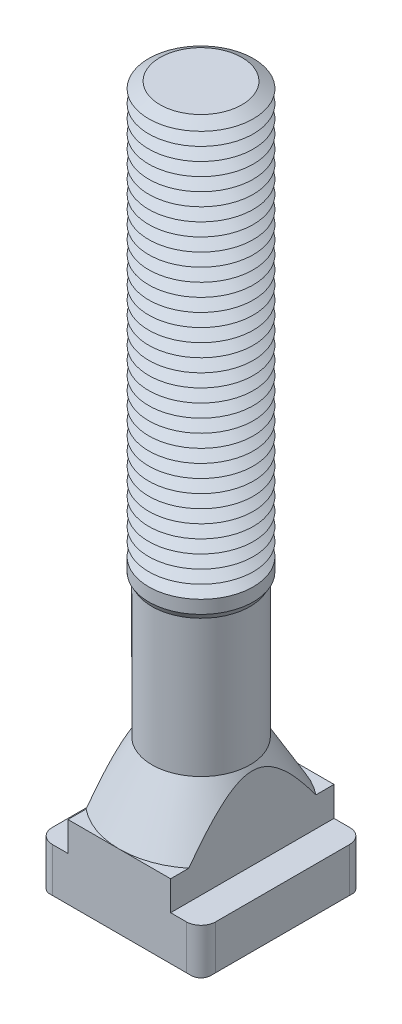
ISO-10303-21;
HEADER;
FILE_DESCRIPTION(('STEP AP214'),'2;1');
FILE_NAME('part.step','',(''),(''),'','','');
FILE_SCHEMA(('AUTOMOTIVE_DESIGN { 1 0 10303 214 1 1 1 1 }'));
ENDSEC;
DATA;
#1=APPLICATION_CONTEXT('core data for automotive mechanical design processes');
#2=APPLICATION_PROTOCOL_DEFINITION('international standard','automotive_design',2000,#1);
#3=PRODUCT_CONTEXT('',#1,'mechanical');
#4=PRODUCT('Part','Part','',(#3));
#5=PRODUCT_RELATED_PRODUCT_CATEGORY('part','',(#4));
#6=PRODUCT_DEFINITION_FORMATION('','',#4);
#7=PRODUCT_DEFINITION_CONTEXT('part definition',#1,'design');
#8=PRODUCT_DEFINITION('design','',#6,#7);
#9=PRODUCT_DEFINITION_SHAPE('','',#8);
#10=(LENGTH_UNIT() NAMED_UNIT(*) SI_UNIT(.MILLI.,.METRE.));
#11=(NAMED_UNIT(*) PLANE_ANGLE_UNIT() SI_UNIT($,.RADIAN.));
#12=(NAMED_UNIT(*) SI_UNIT($,.STERADIAN.) SOLID_ANGLE_UNIT());
#13=UNCERTAINTY_MEASURE_WITH_UNIT(LENGTH_MEASURE(1.E-05),#10,'distance_accuracy_value','');
#14=(GEOMETRIC_REPRESENTATION_CONTEXT(3) GLOBAL_UNCERTAINTY_ASSIGNED_CONTEXT((#13)) GLOBAL_UNIT_ASSIGNED_CONTEXT((#10,
#11,#12)) REPRESENTATION_CONTEXT('',''));
#15=CARTESIAN_POINT('',(0.,0.,0.));
#16=DIRECTION('',(0.,0.,1.));
#17=DIRECTION('',(1.,0.,0.));
#18=AXIS2_PLACEMENT_3D('',#15,#16,#17);
#19=CARTESIAN_POINT('',(0.,101.,0.));
#20=DIRECTION('',(0.,-1.,0.));
#21=DIRECTION('',(0.,0.,-1.));
#22=AXIS2_PLACEMENT_3D('',#19,#20,#21);
#23=CONICAL_SURFACE('',#22,6.26794919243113,1.0471975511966);
#24=CARTESIAN_POINT('',(0.,100.,0.));
#25=DIRECTION('',(0.,-1.,0.));
#26=DIRECTION('',(0.,0.,-1.));
#27=AXIS2_PLACEMENT_3D('',#24,#25,#26);
#28=CIRCLE('',#27,8.00000000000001);
#29=CARTESIAN_POINT('',(0.,100.,-8.00000000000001));
#30=VERTEX_POINT('',#29);
#31=EDGE_CURVE('E707',#30,#30,#28,.T.);
#32=ORIENTED_EDGE('',*,*,#31,.F.);
#33=EDGE_LOOP('',(#32));
#34=FACE_BOUND('',#33,.T.);
#35=CARTESIAN_POINT('',(0.,101.,0.));
#36=DIRECTION('',(0.,-1.,0.));
#37=DIRECTION('',(0.,0.,-1.));
#38=AXIS2_PLACEMENT_3D('',#35,#36,#37);
#39=CIRCLE('',#38,6.26794919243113);
#40=CARTESIAN_POINT('',(0.,101.,-6.26794919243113));
#41=VERTEX_POINT('',#40);
#42=EDGE_CURVE('E698',#41,#41,#39,.T.);
#43=ORIENTED_EDGE('',*,*,#42,.T.);
#44=EDGE_LOOP('',(#43));
#45=FACE_BOUND('',#44,.T.);
#46=ADVANCED_FACE('F39',(#34,#45),#23,.T.);
#47=CARTESIAN_POINT('',(0.,102.,0.));
#48=DIRECTION('',(0.,1.,0.));
#49=DIRECTION('',(0.,0.,1.));
#50=AXIS2_PLACEMENT_3D('',#47,#48,#49);
#51=CONICAL_SURFACE('',#50,8.00000000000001,1.0471975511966);
#52=ORIENTED_EDGE('',*,*,#42,.F.);
#53=EDGE_LOOP('',(#52));
#54=FACE_BOUND('',#53,.T.);
#55=CARTESIAN_POINT('',(0.,102.,0.));
#56=DIRECTION('',(0.,-1.,0.));
#57=DIRECTION('',(0.,0.,-1.));
#58=AXIS2_PLACEMENT_3D('',#55,#56,#57);
#59=CIRCLE('',#58,8.00000000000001);
#60=CARTESIAN_POINT('',(0.,102.,-8.00000000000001));
#61=VERTEX_POINT('',#60);
#62=EDGE_CURVE('E696',#61,#61,#59,.T.);
#63=ORIENTED_EDGE('',*,*,#62,.T.);
#64=EDGE_LOOP('',(#63));
#65=FACE_BOUND('',#64,.T.);
#66=ADVANCED_FACE('F449',(#54,#65),#51,.T.);
#67=CARTESIAN_POINT('',(3.96999763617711,109.,0.));
#68=DIRECTION('',(0.,-1.,0.));
#69=DIRECTION('',(1.,0.,0.));
#70=AXIS2_PLACEMENT_3D('',#67,#68,#69);
#71=PLANE('',#70);
#72=CARTESIAN_POINT('',(0.,109.,0.));
#73=DIRECTION('',(0.,-1.,0.));
#74=DIRECTION('',(0.,0.,-1.));
#75=AXIS2_PLACEMENT_3D('',#72,#73,#74);
#76=CIRCLE('',#75,6.26794919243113);
#77=CARTESIAN_POINT('',(0.,109.,-6.26794919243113));
#78=VERTEX_POINT('',#77);
#79=EDGE_CURVE('E677',#78,#78,#76,.T.);
#80=ORIENTED_EDGE('',*,*,#79,.F.);
#81=EDGE_LOOP('',(#80));
#82=FACE_BOUND('',#81,.T.);
#83=ADVANCED_FACE('F455',(#82),#71,.F.);
#84=CARTESIAN_POINT('',(0.,109.,0.));
#85=DIRECTION('',(0.,-1.,0.));
#86=DIRECTION('',(0.,0.,-1.));
#87=AXIS2_PLACEMENT_3D('',#84,#85,#86);
#88=CONICAL_SURFACE('',#87,6.26794919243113,1.0471975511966);
#89=CARTESIAN_POINT('',(0.,108.,0.));
#90=DIRECTION('',(0.,-1.,0.));
#91=DIRECTION('',(0.,0.,-1.));
#92=AXIS2_PLACEMENT_3D('',#89,#90,#91);
#93=CIRCLE('',#92,8.00000000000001);
#94=CARTESIAN_POINT('',(0.,108.,-8.00000000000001));
#95=VERTEX_POINT('',#94);
#96=EDGE_CURVE('E722',#95,#95,#93,.T.);
#97=ORIENTED_EDGE('',*,*,#96,.F.);
#98=EDGE_LOOP('',(#97));
#99=FACE_BOUND('',#98,.T.);
#100=ORIENTED_EDGE('',*,*,#79,.T.);
#101=EDGE_LOOP('',(#100));
#102=FACE_BOUND('',#101,.T.);
#103=ADVANCED_FACE('F483',(#99,#102),#88,.T.);
#104=CARTESIAN_POINT('',(0.,108.,0.));
#105=DIRECTION('',(0.,1.,0.));
#106=DIRECTION('',(0.,0.,1.));
#107=AXIS2_PLACEMENT_3D('',#104,#105,#106);
#108=CONICAL_SURFACE('',#107,8.00000000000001,1.0471975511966);
#109=CARTESIAN_POINT('',(0.,107.,0.));
#110=DIRECTION('',(0.,-1.,0.));
#111=DIRECTION('',(0.,0.,-1.));
#112=AXIS2_PLACEMENT_3D('',#109,#110,#111);
#113=CIRCLE('',#112,6.26794919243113);
#114=CARTESIAN_POINT('',(0.,107.,-6.26794919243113));
#115=VERTEX_POINT('',#114);
#116=EDGE_CURVE('E718',#115,#115,#113,.T.);
#117=ORIENTED_EDGE('',*,*,#116,.F.);
#118=EDGE_LOOP('',(#117));
#119=FACE_BOUND('',#118,.T.);
#120=ORIENTED_EDGE('',*,*,#96,.T.);
#121=EDGE_LOOP('',(#120));
#122=FACE_BOUND('',#121,.T.);
#123=ADVANCED_FACE('F480',(#119,#122),#108,.T.);
#124=CARTESIAN_POINT('',(0.,107.,0.));
#125=DIRECTION('',(0.,-1.,0.));
#126=DIRECTION('',(0.,0.,-1.));
#127=AXIS2_PLACEMENT_3D('',#124,#125,#126);
#128=CONICAL_SURFACE('',#127,6.26794919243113,1.0471975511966);
#129=CARTESIAN_POINT('',(0.,106.,0.));
#130=DIRECTION('',(0.,-1.,0.));
#131=DIRECTION('',(0.,0.,-1.));
#132=AXIS2_PLACEMENT_3D('',#129,#130,#131);
#133=CIRCLE('',#132,8.00000000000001);
#134=CARTESIAN_POINT('',(0.,106.,-8.00000000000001));
#135=VERTEX_POINT('',#134);
#136=EDGE_CURVE('E714',#135,#135,#133,.T.);
#137=ORIENTED_EDGE('',*,*,#136,.F.);
#138=EDGE_LOOP('',(#137));
#139=FACE_BOUND('',#138,.T.);
#140=ORIENTED_EDGE('',*,*,#116,.T.);
#141=EDGE_LOOP('',(#140));
#142=FACE_BOUND('',#141,.T.);
#143=ADVANCED_FACE('F475',(#139,#142),#128,.T.);
#144=CARTESIAN_POINT('',(0.,106.,0.));
#145=DIRECTION('',(0.,1.,0.));
#146=DIRECTION('',(0.,0.,1.));
#147=AXIS2_PLACEMENT_3D('',#144,#145,#146);
#148=CONICAL_SURFACE('',#147,8.00000000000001,1.0471975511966);
#149=CARTESIAN_POINT('',(0.,105.,0.));
#150=DIRECTION('',(0.,-1.,0.));
#151=DIRECTION('',(0.,0.,-1.));
#152=AXIS2_PLACEMENT_3D('',#149,#150,#151);
#153=CIRCLE('',#152,6.26794919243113);
#154=CARTESIAN_POINT('',(0.,105.,-6.26794919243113));
#155=VERTEX_POINT('',#154);
#156=EDGE_CURVE('E693',#155,#155,#153,.T.);
#157=ORIENTED_EDGE('',*,*,#156,.F.);
#158=EDGE_LOOP('',(#157));
#159=FACE_BOUND('',#158,.T.);
#160=ORIENTED_EDGE('',*,*,#136,.T.);
#161=EDGE_LOOP('',(#160));
#162=FACE_BOUND('',#161,.T.);
#163=ADVANCED_FACE('F472',(#159,#162),#148,.T.);
#164=CARTESIAN_POINT('',(0.,105.,0.));
#165=DIRECTION('',(0.,-1.,0.));
#166=DIRECTION('',(0.,0.,-1.));
#167=AXIS2_PLACEMENT_3D('',#164,#165,#166);
#168=CONICAL_SURFACE('',#167,6.26794919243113,1.0471975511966);
#169=CARTESIAN_POINT('',(0.,104.,0.));
#170=DIRECTION('',(0.,-1.,0.));
#171=DIRECTION('',(0.,0.,-1.));
#172=AXIS2_PLACEMENT_3D('',#169,#170,#171);
#173=CIRCLE('',#172,8.00000000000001);
#174=CARTESIAN_POINT('',(0.,104.,-8.00000000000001));
#175=VERTEX_POINT('',#174);
#176=EDGE_CURVE('E691',#175,#175,#173,.T.);
#177=ORIENTED_EDGE('',*,*,#176,.F.);
#178=EDGE_LOOP('',(#177));
#179=FACE_BOUND('',#178,.T.);
#180=ORIENTED_EDGE('',*,*,#156,.T.);
#181=EDGE_LOOP('',(#180));
#182=FACE_BOUND('',#181,.T.);
#183=ADVANCED_FACE('F466',(#179,#182),#168,.T.);
#184=CARTESIAN_POINT('',(0.,104.,0.));
#185=DIRECTION('',(0.,1.,0.));
#186=DIRECTION('',(0.,0.,1.));
#187=AXIS2_PLACEMENT_3D('',#184,#185,#186);
#188=CONICAL_SURFACE('',#187,8.00000000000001,1.0471975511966);
#189=CARTESIAN_POINT('',(0.,103.,0.));
#190=DIRECTION('',(0.,-1.,0.));
#191=DIRECTION('',(0.,0.,-1.));
#192=AXIS2_PLACEMENT_3D('',#189,#190,#191);
#193=CIRCLE('',#192,6.26794919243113);
#194=CARTESIAN_POINT('',(0.,103.,-6.26794919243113));
#195=VERTEX_POINT('',#194);
#196=EDGE_CURVE('E694',#195,#195,#193,.T.);
#197=ORIENTED_EDGE('',*,*,#196,.F.);
#198=EDGE_LOOP('',(#197));
#199=FACE_BOUND('',#198,.T.);
#200=ORIENTED_EDGE('',*,*,#176,.T.);
#201=EDGE_LOOP('',(#200));
#202=FACE_BOUND('',#201,.T.);
#203=ADVANCED_FACE('F462',(#199,#202),#188,.T.);
#204=CARTESIAN_POINT('',(0.,103.,0.));
#205=DIRECTION('',(0.,-1.,0.));
#206=DIRECTION('',(0.,0.,-1.));
#207=AXIS2_PLACEMENT_3D('',#204,#205,#206);
#208=CONICAL_SURFACE('',#207,6.26794919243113,1.0471975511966);
#209=ORIENTED_EDGE('',*,*,#62,.F.);
#210=EDGE_LOOP('',(#209));
#211=FACE_BOUND('',#210,.T.);
#212=ORIENTED_EDGE('',*,*,#196,.T.);
#213=EDGE_LOOP('',(#212));
#214=FACE_BOUND('',#213,.T.);
#215=ADVANCED_FACE('F465',(#211,#214),#208,.T.);
#216=CARTESIAN_POINT('',(0.,99.,0.));
#217=DIRECTION('',(0.,-1.,0.));
#218=DIRECTION('',(0.,0.,-1.));
#219=AXIS2_PLACEMENT_3D('',#216,#217,#218);
#220=CONICAL_SURFACE('',#219,6.26794919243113,1.0471975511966);
#221=CARTESIAN_POINT('',(0.,98.,0.));
#222=DIRECTION('',(0.,-1.,0.));
#223=DIRECTION('',(0.,0.,-1.));
#224=AXIS2_PLACEMENT_3D('',#221,#222,#223);
#225=CIRCLE('',#224,8.00000000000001);
#226=CARTESIAN_POINT('',(0.,98.,-8.00000000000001));
#227=VERTEX_POINT('',#226);
#228=EDGE_CURVE('E768',#227,#227,#225,.T.);
#229=ORIENTED_EDGE('',*,*,#228,.F.);
#230=EDGE_LOOP('',(#229));
#231=FACE_BOUND('',#230,.T.);
#232=CARTESIAN_POINT('',(0.,99.,0.));
#233=DIRECTION('',(0.,-1.,0.));
#234=DIRECTION('',(0.,0.,-1.));
#235=AXIS2_PLACEMENT_3D('',#232,#233,#234);
#236=CIRCLE('',#235,6.26794919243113);
#237=CARTESIAN_POINT('',(0.,99.,-6.26794919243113));
#238=VERTEX_POINT('',#237);
#239=EDGE_CURVE('E766',#238,#238,#236,.T.);
#240=ORIENTED_EDGE('',*,*,#239,.T.);
#241=EDGE_LOOP('',(#240));
#242=FACE_BOUND('',#241,.T.);
#243=ADVANCED_FACE('F470',(#231,#242),#220,.T.);
#244=CARTESIAN_POINT('',(0.,100.,0.));
#245=DIRECTION('',(0.,1.,0.));
#246=DIRECTION('',(0.,0.,1.));
#247=AXIS2_PLACEMENT_3D('',#244,#245,#246);
#248=CONICAL_SURFACE('',#247,8.00000000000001,1.0471975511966);
#249=ORIENTED_EDGE('',*,*,#239,.F.);
#250=EDGE_LOOP('',(#249));
#251=FACE_BOUND('',#250,.T.);
#252=ORIENTED_EDGE('',*,*,#31,.T.);
#253=EDGE_LOOP('',(#252));
#254=FACE_BOUND('',#253,.T.);
#255=ADVANCED_FACE('F794',(#251,#254),#248,.T.);
#256=CARTESIAN_POINT('',(0.,97.,0.));
#257=DIRECTION('',(0.,-1.,0.));
#258=DIRECTION('',(0.,0.,-1.));
#259=AXIS2_PLACEMENT_3D('',#256,#257,#258);
#260=CONICAL_SURFACE('',#259,6.26794919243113,1.0471975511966);
#261=CARTESIAN_POINT('',(0.,96.,0.));
#262=DIRECTION('',(0.,-1.,0.));
#263=DIRECTION('',(0.,0.,-1.));
#264=AXIS2_PLACEMENT_3D('',#261,#262,#263);
#265=CIRCLE('',#264,8.00000000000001);
#266=CARTESIAN_POINT('',(0.,96.,-8.00000000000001));
#267=VERTEX_POINT('',#266);
#268=EDGE_CURVE('E652',#267,#267,#265,.T.);
#269=ORIENTED_EDGE('',*,*,#268,.F.);
#270=EDGE_LOOP('',(#269));
#271=FACE_BOUND('',#270,.T.);
#272=CARTESIAN_POINT('',(0.,97.,0.));
#273=DIRECTION('',(0.,-1.,0.));
#274=DIRECTION('',(0.,0.,-1.));
#275=AXIS2_PLACEMENT_3D('',#272,#273,#274);
#276=CIRCLE('',#275,6.26794919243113);
#277=CARTESIAN_POINT('',(0.,97.,-6.26794919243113));
#278=VERTEX_POINT('',#277);
#279=EDGE_CURVE('E655',#278,#278,#276,.T.);
#280=ORIENTED_EDGE('',*,*,#279,.T.);
#281=EDGE_LOOP('',(#280));
#282=FACE_BOUND('',#281,.T.);
#283=ADVANCED_FACE('F796',(#271,#282),#260,.T.);
#284=CARTESIAN_POINT('',(0.,98.,0.));
#285=DIRECTION('',(0.,1.,0.));
#286=DIRECTION('',(0.,0.,1.));
#287=AXIS2_PLACEMENT_3D('',#284,#285,#286);
#288=CONICAL_SURFACE('',#287,8.00000000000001,1.0471975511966);
#289=ORIENTED_EDGE('',*,*,#279,.F.);
#290=EDGE_LOOP('',(#289));
#291=FACE_BOUND('',#290,.T.);
#292=ORIENTED_EDGE('',*,*,#228,.T.);
#293=EDGE_LOOP('',(#292));
#294=FACE_BOUND('',#293,.T.);
#295=ADVANCED_FACE('F803',(#291,#294),#288,.T.);
#296=CARTESIAN_POINT('',(0.,95.,0.));
#297=DIRECTION('',(0.,-1.,0.));
#298=DIRECTION('',(0.,0.,-1.));
#299=AXIS2_PLACEMENT_3D('',#296,#297,#298);
#300=CONICAL_SURFACE('',#299,6.26794919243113,1.0471975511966);
#301=CARTESIAN_POINT('',(0.,94.,0.));
#302=DIRECTION('',(0.,-1.,0.));
#303=DIRECTION('',(0.,0.,-1.));
#304=AXIS2_PLACEMENT_3D('',#301,#302,#303);
#305=CIRCLE('',#304,8.00000000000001);
#306=CARTESIAN_POINT('',(0.,94.,-8.00000000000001));
#307=VERTEX_POINT('',#306);
#308=EDGE_CURVE('E753',#307,#307,#305,.T.);
#309=ORIENTED_EDGE('',*,*,#308,.F.);
#310=EDGE_LOOP('',(#309));
#311=FACE_BOUND('',#310,.T.);
#312=CARTESIAN_POINT('',(0.,95.,0.));
#313=DIRECTION('',(0.,-1.,0.));
#314=DIRECTION('',(0.,0.,-1.));
#315=AXIS2_PLACEMENT_3D('',#312,#313,#314);
#316=CIRCLE('',#315,6.26794919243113);
#317=CARTESIAN_POINT('',(0.,95.,-6.26794919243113));
#318=VERTEX_POINT('',#317);
#319=EDGE_CURVE('E656',#318,#318,#316,.T.);
#320=ORIENTED_EDGE('',*,*,#319,.T.);
#321=EDGE_LOOP('',(#320));
#322=FACE_BOUND('',#321,.T.);
#323=ADVANCED_FACE('F811',(#311,#322),#300,.T.);
#324=CARTESIAN_POINT('',(0.,96.,0.));
#325=DIRECTION('',(0.,1.,0.));
#326=DIRECTION('',(0.,0.,1.));
#327=AXIS2_PLACEMENT_3D('',#324,#325,#326);
#328=CONICAL_SURFACE('',#327,8.00000000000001,1.0471975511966);
#329=ORIENTED_EDGE('',*,*,#319,.F.);
#330=EDGE_LOOP('',(#329));
#331=FACE_BOUND('',#330,.T.);
#332=ORIENTED_EDGE('',*,*,#268,.T.);
#333=EDGE_LOOP('',(#332));
#334=FACE_BOUND('',#333,.T.);
#335=ADVANCED_FACE('F815',(#331,#334),#328,.T.);
#336=CARTESIAN_POINT('',(0.,93.,0.));
#337=DIRECTION('',(0.,-1.,0.));
#338=DIRECTION('',(0.,0.,-1.));
#339=AXIS2_PLACEMENT_3D('',#336,#337,#338);
#340=CONICAL_SURFACE('',#339,6.26794919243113,1.0471975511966);
#341=CARTESIAN_POINT('',(0.,92.,0.));
#342=DIRECTION('',(0.,-1.,0.));
#343=DIRECTION('',(0.,0.,-1.));
#344=AXIS2_PLACEMENT_3D('',#341,#342,#343);
#345=CIRCLE('',#344,8.00000000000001);
#346=CARTESIAN_POINT('',(0.,92.,-8.00000000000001));
#347=VERTEX_POINT('',#346);
#348=EDGE_CURVE('E750',#347,#347,#345,.T.);
#349=ORIENTED_EDGE('',*,*,#348,.F.);
#350=EDGE_LOOP('',(#349));
#351=FACE_BOUND('',#350,.T.);
#352=CARTESIAN_POINT('',(0.,93.,0.));
#353=DIRECTION('',(0.,-1.,0.));
#354=DIRECTION('',(0.,0.,-1.));
#355=AXIS2_PLACEMENT_3D('',#352,#353,#354);
#356=CIRCLE('',#355,6.26794919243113);
#357=CARTESIAN_POINT('',(0.,93.,-6.26794919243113));
#358=VERTEX_POINT('',#357);
#359=EDGE_CURVE('E755',#358,#358,#356,.T.);
#360=ORIENTED_EDGE('',*,*,#359,.T.);
#361=EDGE_LOOP('',(#360));
#362=FACE_BOUND('',#361,.T.);
#363=ADVANCED_FACE('F819',(#351,#362),#340,.T.);
#364=CARTESIAN_POINT('',(0.,94.,0.));
#365=DIRECTION('',(0.,1.,0.));
#366=DIRECTION('',(0.,0.,1.));
#367=AXIS2_PLACEMENT_3D('',#364,#365,#366);
#368=CONICAL_SURFACE('',#367,8.00000000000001,1.0471975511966);
#369=ORIENTED_EDGE('',*,*,#359,.F.);
#370=EDGE_LOOP('',(#369));
#371=FACE_BOUND('',#370,.T.);
#372=ORIENTED_EDGE('',*,*,#308,.T.);
#373=EDGE_LOOP('',(#372));
#374=FACE_BOUND('',#373,.T.);
#375=ADVANCED_FACE('F823',(#371,#374),#368,.T.);
#376=CARTESIAN_POINT('',(0.,91.,0.));
#377=DIRECTION('',(0.,-1.,0.));
#378=DIRECTION('',(0.,0.,-1.));
#379=AXIS2_PLACEMENT_3D('',#376,#377,#378);
#380=CONICAL_SURFACE('',#379,6.26794919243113,1.0471975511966);
#381=CARTESIAN_POINT('',(0.,90.,0.));
#382=DIRECTION('',(0.,-1.,0.));
#383=DIRECTION('',(0.,0.,-1.));
#384=AXIS2_PLACEMENT_3D('',#381,#382,#383);
#385=CIRCLE('',#384,8.00000000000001);
#386=CARTESIAN_POINT('',(0.,90.,-8.00000000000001));
#387=VERTEX_POINT('',#386);
#388=EDGE_CURVE('E751',#387,#387,#385,.T.);
#389=ORIENTED_EDGE('',*,*,#388,.F.);
#390=EDGE_LOOP('',(#389));
#391=FACE_BOUND('',#390,.T.);
#392=CARTESIAN_POINT('',(0.,91.,0.));
#393=DIRECTION('',(0.,-1.,0.));
#394=DIRECTION('',(0.,0.,-1.));
#395=AXIS2_PLACEMENT_3D('',#392,#393,#394);
#396=CIRCLE('',#395,6.26794919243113);
#397=CARTESIAN_POINT('',(0.,91.,-6.26794919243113));
#398=VERTEX_POINT('',#397);
#399=EDGE_CURVE('E747',#398,#398,#396,.T.);
#400=ORIENTED_EDGE('',*,*,#399,.T.);
#401=EDGE_LOOP('',(#400));
#402=FACE_BOUND('',#401,.T.);
#403=ADVANCED_FACE('F827',(#391,#402),#380,.T.);
#404=CARTESIAN_POINT('',(0.,92.,0.));
#405=DIRECTION('',(0.,1.,0.));
#406=DIRECTION('',(0.,0.,1.));
#407=AXIS2_PLACEMENT_3D('',#404,#405,#406);
#408=CONICAL_SURFACE('',#407,8.00000000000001,1.0471975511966);
#409=ORIENTED_EDGE('',*,*,#399,.F.);
#410=EDGE_LOOP('',(#409));
#411=FACE_BOUND('',#410,.T.);
#412=ORIENTED_EDGE('',*,*,#348,.T.);
#413=EDGE_LOOP('',(#412));
#414=FACE_BOUND('',#413,.T.);
#415=ADVANCED_FACE('F831',(#411,#414),#408,.T.);
#416=CARTESIAN_POINT('',(0.,89.,0.));
#417=DIRECTION('',(0.,-1.,0.));
#418=DIRECTION('',(0.,0.,-1.));
#419=AXIS2_PLACEMENT_3D('',#416,#417,#418);
#420=CONICAL_SURFACE('',#419,6.26794919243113,1.0471975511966);
#421=CARTESIAN_POINT('',(0.,88.,0.));
#422=DIRECTION('',(0.,-1.,0.));
#423=DIRECTION('',(0.,0.,-1.));
#424=AXIS2_PLACEMENT_3D('',#421,#422,#423);
#425=CIRCLE('',#424,8.00000000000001);
#426=CARTESIAN_POINT('',(0.,88.,-8.00000000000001));
#427=VERTEX_POINT('',#426);
#428=EDGE_CURVE('E1105',#427,#427,#425,.T.);
#429=ORIENTED_EDGE('',*,*,#428,.F.);
#430=EDGE_LOOP('',(#429));
#431=FACE_BOUND('',#430,.T.);
#432=CARTESIAN_POINT('',(0.,89.,0.));
#433=DIRECTION('',(0.,-1.,0.));
#434=DIRECTION('',(0.,0.,-1.));
#435=AXIS2_PLACEMENT_3D('',#432,#433,#434);
#436=CIRCLE('',#435,6.26794919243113);
#437=CARTESIAN_POINT('',(0.,89.,-6.26794919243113));
#438=VERTEX_POINT('',#437);
#439=EDGE_CURVE('E1109',#438,#438,#436,.T.);
#440=ORIENTED_EDGE('',*,*,#439,.T.);
#441=EDGE_LOOP('',(#440));
#442=FACE_BOUND('',#441,.T.);
#443=ADVANCED_FACE('F835',(#431,#442),#420,.T.);
#444=CARTESIAN_POINT('',(0.,90.,0.));
#445=DIRECTION('',(0.,1.,0.));
#446=DIRECTION('',(0.,0.,1.));
#447=AXIS2_PLACEMENT_3D('',#444,#445,#446);
#448=CONICAL_SURFACE('',#447,8.00000000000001,1.0471975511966);
#449=ORIENTED_EDGE('',*,*,#439,.F.);
#450=EDGE_LOOP('',(#449));
#451=FACE_BOUND('',#450,.T.);
#452=ORIENTED_EDGE('',*,*,#388,.T.);
#453=EDGE_LOOP('',(#452));
#454=FACE_BOUND('',#453,.T.);
#455=ADVANCED_FACE('F839',(#451,#454),#448,.T.);
#456=CARTESIAN_POINT('',(0.,87.,0.));
#457=DIRECTION('',(0.,-1.,0.));
#458=DIRECTION('',(0.,0.,-1.));
#459=AXIS2_PLACEMENT_3D('',#456,#457,#458);
#460=CONICAL_SURFACE('',#459,6.26794919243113,1.0471975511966);
#461=CARTESIAN_POINT('',(0.,86.,0.));
#462=DIRECTION('',(0.,-1.,0.));
#463=DIRECTION('',(0.,0.,-1.));
#464=AXIS2_PLACEMENT_3D('',#461,#462,#463);
#465=CIRCLE('',#464,8.00000000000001);
#466=CARTESIAN_POINT('',(0.,86.,-8.00000000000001));
#467=VERTEX_POINT('',#466);
#468=EDGE_CURVE('E668',#467,#467,#465,.T.);
#469=ORIENTED_EDGE('',*,*,#468,.F.);
#470=EDGE_LOOP('',(#469));
#471=FACE_BOUND('',#470,.T.);
#472=CARTESIAN_POINT('',(0.,87.,0.));
#473=DIRECTION('',(0.,-1.,0.));
#474=DIRECTION('',(0.,0.,-1.));
#475=AXIS2_PLACEMENT_3D('',#472,#473,#474);
#476=CIRCLE('',#475,6.26794919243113);
#477=CARTESIAN_POINT('',(0.,87.,-6.26794919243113));
#478=VERTEX_POINT('',#477);
#479=EDGE_CURVE('E671',#478,#478,#476,.T.);
#480=ORIENTED_EDGE('',*,*,#479,.T.);
#481=EDGE_LOOP('',(#480));
#482=FACE_BOUND('',#481,.T.);
#483=ADVANCED_FACE('F843',(#471,#482),#460,.T.);
#484=CARTESIAN_POINT('',(0.,88.,0.));
#485=DIRECTION('',(0.,1.,0.));
#486=DIRECTION('',(0.,0.,1.));
#487=AXIS2_PLACEMENT_3D('',#484,#485,#486);
#488=CONICAL_SURFACE('',#487,8.00000000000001,1.0471975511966);
#489=ORIENTED_EDGE('',*,*,#479,.F.);
#490=EDGE_LOOP('',(#489));
#491=FACE_BOUND('',#490,.T.);
#492=ORIENTED_EDGE('',*,*,#428,.T.);
#493=EDGE_LOOP('',(#492));
#494=FACE_BOUND('',#493,.T.);
#495=ADVANCED_FACE('F847',(#491,#494),#488,.T.);
#496=CARTESIAN_POINT('',(0.,85.,0.));
#497=DIRECTION('',(0.,-1.,0.));
#498=DIRECTION('',(0.,0.,-1.));
#499=AXIS2_PLACEMENT_3D('',#496,#497,#498);
#500=CONICAL_SURFACE('',#499,6.26794919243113,1.0471975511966);
#501=CARTESIAN_POINT('',(0.,84.,0.));
#502=DIRECTION('',(0.,-1.,0.));
#503=DIRECTION('',(0.,0.,-1.));
#504=AXIS2_PLACEMENT_3D('',#501,#502,#503);
#505=CIRCLE('',#504,8.00000000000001);
#506=CARTESIAN_POINT('',(0.,84.,-8.00000000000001));
#507=VERTEX_POINT('',#506);
#508=EDGE_CURVE('E764',#507,#507,#505,.T.);
#509=ORIENTED_EDGE('',*,*,#508,.F.);
#510=EDGE_LOOP('',(#509));
#511=FACE_BOUND('',#510,.T.);
#512=CARTESIAN_POINT('',(0.,85.,0.));
#513=DIRECTION('',(0.,-1.,0.));
#514=DIRECTION('',(0.,0.,-1.));
#515=AXIS2_PLACEMENT_3D('',#512,#513,#514);
#516=CIRCLE('',#515,6.26794919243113);
#517=CARTESIAN_POINT('',(0.,85.,-6.26794919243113));
#518=VERTEX_POINT('',#517);
#519=EDGE_CURVE('E672',#518,#518,#516,.T.);
#520=ORIENTED_EDGE('',*,*,#519,.T.);
#521=EDGE_LOOP('',(#520));
#522=FACE_BOUND('',#521,.T.);
#523=ADVANCED_FACE('F851',(#511,#522),#500,.T.);
#524=CARTESIAN_POINT('',(0.,86.,0.));
#525=DIRECTION('',(0.,1.,0.));
#526=DIRECTION('',(0.,0.,1.));
#527=AXIS2_PLACEMENT_3D('',#524,#525,#526);
#528=CONICAL_SURFACE('',#527,8.00000000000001,1.0471975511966);
#529=ORIENTED_EDGE('',*,*,#519,.F.);
#530=EDGE_LOOP('',(#529));
#531=FACE_BOUND('',#530,.T.);
#532=ORIENTED_EDGE('',*,*,#468,.T.);
#533=EDGE_LOOP('',(#532));
#534=FACE_BOUND('',#533,.T.);
#535=ADVANCED_FACE('F855',(#531,#534),#528,.T.);
#536=CARTESIAN_POINT('',(0.,83.,0.));
#537=DIRECTION('',(0.,-1.,0.));
#538=DIRECTION('',(0.,0.,-1.));
#539=AXIS2_PLACEMENT_3D('',#536,#537,#538);
#540=CONICAL_SURFACE('',#539,6.26794919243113,1.0471975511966);
#541=CARTESIAN_POINT('',(0.,82.,0.));
#542=DIRECTION('',(0.,-1.,0.));
#543=DIRECTION('',(0.,0.,-1.));
#544=AXIS2_PLACEMENT_3D('',#541,#542,#543);
#545=CIRCLE('',#544,8.00000000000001);
#546=CARTESIAN_POINT('',(0.,82.,-8.00000000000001));
#547=VERTEX_POINT('',#546);
#548=EDGE_CURVE('E631',#547,#547,#545,.T.);
#549=ORIENTED_EDGE('',*,*,#548,.F.);
#550=EDGE_LOOP('',(#549));
#551=FACE_BOUND('',#550,.T.);
#552=CARTESIAN_POINT('',(0.,83.,0.));
#553=DIRECTION('',(0.,-1.,0.));
#554=DIRECTION('',(0.,0.,-1.));
#555=AXIS2_PLACEMENT_3D('',#552,#553,#554);
#556=CIRCLE('',#555,6.26794919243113);
#557=CARTESIAN_POINT('',(0.,83.,-6.26794919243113));
#558=VERTEX_POINT('',#557);
#559=EDGE_CURVE('E1095',#558,#558,#556,.T.);
#560=ORIENTED_EDGE('',*,*,#559,.T.);
#561=EDGE_LOOP('',(#560));
#562=FACE_BOUND('',#561,.T.);
#563=ADVANCED_FACE('F859',(#551,#562),#540,.T.);
#564=CARTESIAN_POINT('',(0.,84.,0.));
#565=DIRECTION('',(0.,1.,0.));
#566=DIRECTION('',(0.,0.,1.));
#567=AXIS2_PLACEMENT_3D('',#564,#565,#566);
#568=CONICAL_SURFACE('',#567,8.00000000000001,1.0471975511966);
#569=ORIENTED_EDGE('',*,*,#559,.F.);
#570=EDGE_LOOP('',(#569));
#571=FACE_BOUND('',#570,.T.);
#572=ORIENTED_EDGE('',*,*,#508,.T.);
#573=EDGE_LOOP('',(#572));
#574=FACE_BOUND('',#573,.T.);
#575=ADVANCED_FACE('F863',(#571,#574),#568,.T.);
#576=CARTESIAN_POINT('',(0.,81.,0.));
#577=DIRECTION('',(0.,-1.,0.));
#578=DIRECTION('',(0.,0.,-1.));
#579=AXIS2_PLACEMENT_3D('',#576,#577,#578);
#580=CONICAL_SURFACE('',#579,6.26794919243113,1.0471975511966);
#581=CARTESIAN_POINT('',(0.,80.,0.));
#582=DIRECTION('',(0.,-1.,0.));
#583=DIRECTION('',(0.,0.,-1.));
#584=AXIS2_PLACEMENT_3D('',#581,#582,#583);
#585=CIRCLE('',#584,8.00000000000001);
#586=CARTESIAN_POINT('',(0.,80.,-8.00000000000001));
#587=VERTEX_POINT('',#586);
#588=EDGE_CURVE('E1085',#587,#587,#585,.T.);
#589=ORIENTED_EDGE('',*,*,#588,.F.);
#590=EDGE_LOOP('',(#589));
#591=FACE_BOUND('',#590,.T.);
#592=CARTESIAN_POINT('',(0.,81.,0.));
#593=DIRECTION('',(0.,-1.,0.));
#594=DIRECTION('',(0.,0.,-1.));
#595=AXIS2_PLACEMENT_3D('',#592,#593,#594);
#596=CIRCLE('',#595,6.26794919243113);
#597=CARTESIAN_POINT('',(0.,81.,-6.26794919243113));
#598=VERTEX_POINT('',#597);
#599=EDGE_CURVE('E1089',#598,#598,#596,.T.);
#600=ORIENTED_EDGE('',*,*,#599,.T.);
#601=EDGE_LOOP('',(#600));
#602=FACE_BOUND('',#601,.T.);
#603=ADVANCED_FACE('F867',(#591,#602),#580,.T.);
#604=CARTESIAN_POINT('',(0.,82.,0.));
#605=DIRECTION('',(0.,1.,0.));
#606=DIRECTION('',(0.,0.,1.));
#607=AXIS2_PLACEMENT_3D('',#604,#605,#606);
#608=CONICAL_SURFACE('',#607,8.00000000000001,1.0471975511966);
#609=ORIENTED_EDGE('',*,*,#599,.F.);
#610=EDGE_LOOP('',(#609));
#611=FACE_BOUND('',#610,.T.);
#612=ORIENTED_EDGE('',*,*,#548,.T.);
#613=EDGE_LOOP('',(#612));
#614=FACE_BOUND('',#613,.T.);
#615=ADVANCED_FACE('F871',(#611,#614),#608,.T.);
#616=CARTESIAN_POINT('',(0.,79.,0.));
#617=DIRECTION('',(0.,-1.,0.));
#618=DIRECTION('',(0.,0.,-1.));
#619=AXIS2_PLACEMENT_3D('',#616,#617,#618);
#620=CONICAL_SURFACE('',#619,6.26794919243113,1.0471975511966);
#621=CARTESIAN_POINT('',(0.,78.,0.));
#622=DIRECTION('',(0.,-1.,0.));
#623=DIRECTION('',(0.,0.,-1.));
#624=AXIS2_PLACEMENT_3D('',#621,#622,#623);
#625=CIRCLE('',#624,8.00000000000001);
#626=CARTESIAN_POINT('',(0.,78.,-8.00000000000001));
#627=VERTEX_POINT('',#626);
#628=EDGE_CURVE('E1077',#627,#627,#625,.T.);
#629=ORIENTED_EDGE('',*,*,#628,.F.);
#630=EDGE_LOOP('',(#629));
#631=FACE_BOUND('',#630,.T.);
#632=CARTESIAN_POINT('',(0.,79.,0.));
#633=DIRECTION('',(0.,-1.,0.));
#634=DIRECTION('',(0.,0.,-1.));
#635=AXIS2_PLACEMENT_3D('',#632,#633,#634);
#636=CIRCLE('',#635,6.26794919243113);
#637=CARTESIAN_POINT('',(0.,79.,-6.26794919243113));
#638=VERTEX_POINT('',#637);
#639=EDGE_CURVE('E1081',#638,#638,#636,.T.);
#640=ORIENTED_EDGE('',*,*,#639,.T.);
#641=EDGE_LOOP('',(#640));
#642=FACE_BOUND('',#641,.T.);
#643=ADVANCED_FACE('F875',(#631,#642),#620,.T.);
#644=CARTESIAN_POINT('',(0.,80.,0.));
#645=DIRECTION('',(0.,1.,0.));
#646=DIRECTION('',(0.,0.,1.));
#647=AXIS2_PLACEMENT_3D('',#644,#645,#646);
#648=CONICAL_SURFACE('',#647,8.00000000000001,1.0471975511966);
#649=ORIENTED_EDGE('',*,*,#639,.F.);
#650=EDGE_LOOP('',(#649));
#651=FACE_BOUND('',#650,.T.);
#652=ORIENTED_EDGE('',*,*,#588,.T.);
#653=EDGE_LOOP('',(#652));
#654=FACE_BOUND('',#653,.T.);
#655=ADVANCED_FACE('F879',(#651,#654),#648,.T.);
#656=CARTESIAN_POINT('',(0.,77.,0.));
#657=DIRECTION('',(0.,-1.,0.));
#658=DIRECTION('',(0.,0.,-1.));
#659=AXIS2_PLACEMENT_3D('',#656,#657,#658);
#660=CONICAL_SURFACE('',#659,6.26794919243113,1.0471975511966);
#661=CARTESIAN_POINT('',(0.,76.,0.));
#662=DIRECTION('',(0.,-1.,0.));
#663=DIRECTION('',(0.,0.,-1.));
#664=AXIS2_PLACEMENT_3D('',#661,#662,#663);
#665=CIRCLE('',#664,8.00000000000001);
#666=CARTESIAN_POINT('',(0.,76.,-8.00000000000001));
#667=VERTEX_POINT('',#666);
#668=EDGE_CURVE('E685',#667,#667,#665,.T.);
#669=ORIENTED_EDGE('',*,*,#668,.F.);
#670=EDGE_LOOP('',(#669));
#671=FACE_BOUND('',#670,.T.);
#672=CARTESIAN_POINT('',(0.,77.,0.));
#673=DIRECTION('',(0.,-1.,0.));
#674=DIRECTION('',(0.,0.,-1.));
#675=AXIS2_PLACEMENT_3D('',#672,#673,#674);
#676=CIRCLE('',#675,6.26794919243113);
#677=CARTESIAN_POINT('',(0.,77.,-6.26794919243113));
#678=VERTEX_POINT('',#677);
#679=EDGE_CURVE('E688',#678,#678,#676,.T.);
#680=ORIENTED_EDGE('',*,*,#679,.T.);
#681=EDGE_LOOP('',(#680));
#682=FACE_BOUND('',#681,.T.);
#683=ADVANCED_FACE('F883',(#671,#682),#660,.T.);
#684=CARTESIAN_POINT('',(0.,78.,0.));
#685=DIRECTION('',(0.,1.,0.));
#686=DIRECTION('',(0.,0.,1.));
#687=AXIS2_PLACEMENT_3D('',#684,#685,#686);
#688=CONICAL_SURFACE('',#687,8.00000000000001,1.0471975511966);
#689=ORIENTED_EDGE('',*,*,#679,.F.);
#690=EDGE_LOOP('',(#689));
#691=FACE_BOUND('',#690,.T.);
#692=ORIENTED_EDGE('',*,*,#628,.T.);
#693=EDGE_LOOP('',(#692));
#694=FACE_BOUND('',#693,.T.);
#695=ADVANCED_FACE('F887',(#691,#694),#688,.T.);
#696=CARTESIAN_POINT('',(0.,75.,0.));
#697=DIRECTION('',(0.,-1.,0.));
#698=DIRECTION('',(0.,0.,-1.));
#699=AXIS2_PLACEMENT_3D('',#696,#697,#698);
#700=CONICAL_SURFACE('',#699,6.26794919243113,1.0471975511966);
#701=CARTESIAN_POINT('',(0.,74.,0.));
#702=DIRECTION('',(0.,-1.,0.));
#703=DIRECTION('',(0.,0.,-1.));
#704=AXIS2_PLACEMENT_3D('',#701,#702,#703);
#705=CIRCLE('',#704,8.00000000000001);
#706=CARTESIAN_POINT('',(0.,74.,-8.00000000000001));
#707=VERTEX_POINT('',#706);
#708=EDGE_CURVE('E779',#707,#707,#705,.T.);
#709=ORIENTED_EDGE('',*,*,#708,.F.);
#710=EDGE_LOOP('',(#709));
#711=FACE_BOUND('',#710,.T.);
#712=CARTESIAN_POINT('',(0.,75.,0.));
#713=DIRECTION('',(0.,-1.,0.));
#714=DIRECTION('',(0.,0.,-1.));
#715=AXIS2_PLACEMENT_3D('',#712,#713,#714);
#716=CIRCLE('',#715,6.26794919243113);
#717=CARTESIAN_POINT('',(0.,75.,-6.26794919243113));
#718=VERTEX_POINT('',#717);
#719=EDGE_CURVE('E689',#718,#718,#716,.T.);
#720=ORIENTED_EDGE('',*,*,#719,.T.);
#721=EDGE_LOOP('',(#720));
#722=FACE_BOUND('',#721,.T.);
#723=ADVANCED_FACE('F891',(#711,#722),#700,.T.);
#724=CARTESIAN_POINT('',(0.,76.,0.));
#725=DIRECTION('',(0.,1.,0.));
#726=DIRECTION('',(0.,0.,1.));
#727=AXIS2_PLACEMENT_3D('',#724,#725,#726);
#728=CONICAL_SURFACE('',#727,8.00000000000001,1.0471975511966);
#729=ORIENTED_EDGE('',*,*,#719,.F.);
#730=EDGE_LOOP('',(#729));
#731=FACE_BOUND('',#730,.T.);
#732=ORIENTED_EDGE('',*,*,#668,.T.);
#733=EDGE_LOOP('',(#732));
#734=FACE_BOUND('',#733,.T.);
#735=ADVANCED_FACE('F895',(#731,#734),#728,.T.);
#736=CARTESIAN_POINT('',(0.,73.,0.));
#737=DIRECTION('',(0.,-1.,0.));
#738=DIRECTION('',(0.,0.,-1.));
#739=AXIS2_PLACEMENT_3D('',#736,#737,#738);
#740=CONICAL_SURFACE('',#739,6.26794919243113,1.0471975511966);
#741=CARTESIAN_POINT('',(0.,72.,0.));
#742=DIRECTION('',(0.,-1.,0.));
#743=DIRECTION('',(0.,0.,-1.));
#744=AXIS2_PLACEMENT_3D('',#741,#742,#743);
#745=CIRCLE('',#744,8.00000000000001);
#746=CARTESIAN_POINT('',(0.,72.,-8.00000000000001));
#747=VERTEX_POINT('',#746);
#748=EDGE_CURVE('E646',#747,#747,#745,.T.);
#749=ORIENTED_EDGE('',*,*,#748,.F.);
#750=EDGE_LOOP('',(#749));
#751=FACE_BOUND('',#750,.T.);
#752=CARTESIAN_POINT('',(0.,73.,0.));
#753=DIRECTION('',(0.,-1.,0.));
#754=DIRECTION('',(0.,0.,-1.));
#755=AXIS2_PLACEMENT_3D('',#752,#753,#754);
#756=CIRCLE('',#755,6.26794919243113);
#757=CARTESIAN_POINT('',(0.,73.,-6.26794919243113));
#758=VERTEX_POINT('',#757);
#759=EDGE_CURVE('E649',#758,#758,#756,.T.);
#760=ORIENTED_EDGE('',*,*,#759,.T.);
#761=EDGE_LOOP('',(#760));
#762=FACE_BOUND('',#761,.T.);
#763=ADVANCED_FACE('F899',(#751,#762),#740,.T.);
#764=CARTESIAN_POINT('',(0.,74.,0.));
#765=DIRECTION('',(0.,1.,0.));
#766=DIRECTION('',(0.,0.,1.));
#767=AXIS2_PLACEMENT_3D('',#764,#765,#766);
#768=CONICAL_SURFACE('',#767,8.00000000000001,1.0471975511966);
#769=ORIENTED_EDGE('',*,*,#759,.F.);
#770=EDGE_LOOP('',(#769));
#771=FACE_BOUND('',#770,.T.);
#772=ORIENTED_EDGE('',*,*,#708,.T.);
#773=EDGE_LOOP('',(#772));
#774=FACE_BOUND('',#773,.T.);
#775=ADVANCED_FACE('F903',(#771,#774),#768,.T.);
#776=CARTESIAN_POINT('',(0.,71.,0.));
#777=DIRECTION('',(0.,-1.,0.));
#778=DIRECTION('',(0.,0.,-1.));
#779=AXIS2_PLACEMENT_3D('',#776,#777,#778);
#780=CONICAL_SURFACE('',#779,6.26794919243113,1.0471975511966);
#781=CARTESIAN_POINT('',(0.,70.,0.));
#782=DIRECTION('',(0.,-1.,0.));
#783=DIRECTION('',(0.,0.,-1.));
#784=AXIS2_PLACEMENT_3D('',#781,#782,#783);
#785=CIRCLE('',#784,8.00000000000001);
#786=CARTESIAN_POINT('',(0.,70.,-8.00000000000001));
#787=VERTEX_POINT('',#786);
#788=EDGE_CURVE('E742',#787,#787,#785,.T.);
#789=ORIENTED_EDGE('',*,*,#788,.F.);
#790=EDGE_LOOP('',(#789));
#791=FACE_BOUND('',#790,.T.);
#792=CARTESIAN_POINT('',(0.,71.,0.));
#793=DIRECTION('',(0.,-1.,0.));
#794=DIRECTION('',(0.,0.,-1.));
#795=AXIS2_PLACEMENT_3D('',#792,#793,#794);
#796=CIRCLE('',#795,6.26794919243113);
#797=CARTESIAN_POINT('',(0.,71.,-6.26794919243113));
#798=VERTEX_POINT('',#797);
#799=EDGE_CURVE('E650',#798,#798,#796,.T.);
#800=ORIENTED_EDGE('',*,*,#799,.T.);
#801=EDGE_LOOP('',(#800));
#802=FACE_BOUND('',#801,.T.);
#803=ADVANCED_FACE('F907',(#791,#802),#780,.T.);
#804=CARTESIAN_POINT('',(0.,72.,0.));
#805=DIRECTION('',(0.,1.,0.));
#806=DIRECTION('',(0.,0.,1.));
#807=AXIS2_PLACEMENT_3D('',#804,#805,#806);
#808=CONICAL_SURFACE('',#807,8.00000000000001,1.0471975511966);
#809=ORIENTED_EDGE('',*,*,#799,.F.);
#810=EDGE_LOOP('',(#809));
#811=FACE_BOUND('',#810,.T.);
#812=ORIENTED_EDGE('',*,*,#748,.T.);
#813=EDGE_LOOP('',(#812));
#814=FACE_BOUND('',#813,.T.);
#815=ADVANCED_FACE('F911',(#811,#814),#808,.T.);
#816=CARTESIAN_POINT('',(0.,69.,0.));
#817=DIRECTION('',(0.,-1.,0.));
#818=DIRECTION('',(0.,0.,-1.));
#819=AXIS2_PLACEMENT_3D('',#816,#817,#818);
#820=CONICAL_SURFACE('',#819,6.26794919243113,1.0471975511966);
#821=CARTESIAN_POINT('',(0.,68.,0.));
#822=DIRECTION('',(0.,-1.,0.));
#823=DIRECTION('',(0.,0.,-1.));
#824=AXIS2_PLACEMENT_3D('',#821,#822,#823);
#825=CIRCLE('',#824,8.00000000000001);
#826=CARTESIAN_POINT('',(0.,68.,-8.00000000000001));
#827=VERTEX_POINT('',#826);
#828=EDGE_CURVE('E1059',#827,#827,#825,.T.);
#829=ORIENTED_EDGE('',*,*,#828,.F.);
#830=EDGE_LOOP('',(#829));
#831=FACE_BOUND('',#830,.T.);
#832=CARTESIAN_POINT('',(0.,69.,0.));
#833=DIRECTION('',(0.,-1.,0.));
#834=DIRECTION('',(0.,0.,-1.));
#835=AXIS2_PLACEMENT_3D('',#832,#833,#834);
#836=CIRCLE('',#835,6.26794919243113);
#837=CARTESIAN_POINT('',(0.,69.,-6.26794919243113));
#838=VERTEX_POINT('',#837);
#839=EDGE_CURVE('E745',#838,#838,#836,.T.);
#840=ORIENTED_EDGE('',*,*,#839,.T.);
#841=EDGE_LOOP('',(#840));
#842=FACE_BOUND('',#841,.T.);
#843=ADVANCED_FACE('F915',(#831,#842),#820,.T.);
#844=CARTESIAN_POINT('',(0.,70.,0.));
#845=DIRECTION('',(0.,1.,0.));
#846=DIRECTION('',(0.,0.,1.));
#847=AXIS2_PLACEMENT_3D('',#844,#845,#846);
#848=CONICAL_SURFACE('',#847,8.00000000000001,1.0471975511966);
#849=ORIENTED_EDGE('',*,*,#839,.F.);
#850=EDGE_LOOP('',(#849));
#851=FACE_BOUND('',#850,.T.);
#852=ORIENTED_EDGE('',*,*,#788,.T.);
#853=EDGE_LOOP('',(#852));
#854=FACE_BOUND('',#853,.T.);
#855=ADVANCED_FACE('F919',(#851,#854),#848,.T.);
#856=CARTESIAN_POINT('',(0.,67.,0.));
#857=DIRECTION('',(0.,-1.,0.));
#858=DIRECTION('',(0.,0.,-1.));
#859=AXIS2_PLACEMENT_3D('',#856,#857,#858);
#860=CONICAL_SURFACE('',#859,6.26794919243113,1.0471975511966);
#861=CARTESIAN_POINT('',(0.,66.,0.));
#862=DIRECTION('',(0.,-1.,0.));
#863=DIRECTION('',(0.,0.,-1.));
#864=AXIS2_PLACEMENT_3D('',#861,#862,#863);
#865=CIRCLE('',#864,8.00000000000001);
#866=CARTESIAN_POINT('',(0.,66.,-8.00000000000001));
#867=VERTEX_POINT('',#866);
#868=EDGE_CURVE('E665',#867,#867,#865,.T.);
#869=ORIENTED_EDGE('',*,*,#868,.F.);
#870=EDGE_LOOP('',(#869));
#871=FACE_BOUND('',#870,.T.);
#872=CARTESIAN_POINT('',(0.,67.,0.));
#873=DIRECTION('',(0.,-1.,0.));
#874=DIRECTION('',(0.,0.,-1.));
#875=AXIS2_PLACEMENT_3D('',#872,#873,#874);
#876=CIRCLE('',#875,6.26794919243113);
#877=CARTESIAN_POINT('',(0.,67.,-6.26794919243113));
#878=VERTEX_POINT('',#877);
#879=EDGE_CURVE('E1055',#878,#878,#876,.T.);
#880=ORIENTED_EDGE('',*,*,#879,.T.);
#881=EDGE_LOOP('',(#880));
#882=FACE_BOUND('',#881,.T.);
#883=ADVANCED_FACE('F923',(#871,#882),#860,.T.);
#884=CARTESIAN_POINT('',(0.,68.,0.));
#885=DIRECTION('',(0.,1.,0.));
#886=DIRECTION('',(0.,0.,1.));
#887=AXIS2_PLACEMENT_3D('',#884,#885,#886);
#888=CONICAL_SURFACE('',#887,8.00000000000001,1.0471975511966);
#889=ORIENTED_EDGE('',*,*,#879,.F.);
#890=EDGE_LOOP('',(#889));
#891=FACE_BOUND('',#890,.T.);
#892=ORIENTED_EDGE('',*,*,#828,.T.);
#893=EDGE_LOOP('',(#892));
#894=FACE_BOUND('',#893,.T.);
#895=ADVANCED_FACE('F927',(#891,#894),#888,.T.);
#896=CARTESIAN_POINT('',(0.,65.,0.));
#897=DIRECTION('',(0.,-1.,0.));
#898=DIRECTION('',(0.,0.,-1.));
#899=AXIS2_PLACEMENT_3D('',#896,#897,#898);
#900=CONICAL_SURFACE('',#899,6.26794919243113,1.0471975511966);
#901=CARTESIAN_POINT('',(0.,64.,0.));
#902=DIRECTION('',(0.,-1.,0.));
#903=DIRECTION('',(0.,0.,-1.));
#904=AXIS2_PLACEMENT_3D('',#901,#902,#903);
#905=CIRCLE('',#904,8.00000000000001);
#906=CARTESIAN_POINT('',(0.,64.,-8.00000000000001));
#907=VERTEX_POINT('',#906);
#908=EDGE_CURVE('E666',#907,#907,#905,.T.);
#909=ORIENTED_EDGE('',*,*,#908,.F.);
#910=EDGE_LOOP('',(#909));
#911=FACE_BOUND('',#910,.T.);
#912=CARTESIAN_POINT('',(0.,65.,0.));
#913=DIRECTION('',(0.,-1.,0.));
#914=DIRECTION('',(0.,0.,-1.));
#915=AXIS2_PLACEMENT_3D('',#912,#913,#914);
#916=CIRCLE('',#915,6.26794919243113);
#917=CARTESIAN_POINT('',(0.,65.,-6.26794919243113));
#918=VERTEX_POINT('',#917);
#919=EDGE_CURVE('E662',#918,#918,#916,.T.);
#920=ORIENTED_EDGE('',*,*,#919,.T.);
#921=EDGE_LOOP('',(#920));
#922=FACE_BOUND('',#921,.T.);
#923=ADVANCED_FACE('F931',(#911,#922),#900,.T.);
#924=CARTESIAN_POINT('',(0.,66.,0.));
#925=DIRECTION('',(0.,1.,0.));
#926=DIRECTION('',(0.,0.,1.));
#927=AXIS2_PLACEMENT_3D('',#924,#925,#926);
#928=CONICAL_SURFACE('',#927,8.00000000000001,1.0471975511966);
#929=ORIENTED_EDGE('',*,*,#919,.F.);
#930=EDGE_LOOP('',(#929));
#931=FACE_BOUND('',#930,.T.);
#932=ORIENTED_EDGE('',*,*,#868,.T.);
#933=EDGE_LOOP('',(#932));
#934=FACE_BOUND('',#933,.T.);
#935=ADVANCED_FACE('F935',(#931,#934),#928,.T.);
#936=CARTESIAN_POINT('',(0.,63.,0.));
#937=DIRECTION('',(0.,-1.,0.));
#938=DIRECTION('',(0.,0.,-1.));
#939=AXIS2_PLACEMENT_3D('',#936,#937,#938);
#940=CONICAL_SURFACE('',#939,6.26794919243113,1.0471975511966);
#941=CARTESIAN_POINT('',(0.,62.,0.));
#942=DIRECTION('',(0.,-1.,0.));
#943=DIRECTION('',(0.,0.,-1.));
#944=AXIS2_PLACEMENT_3D('',#941,#942,#943);
#945=CIRCLE('',#944,8.00000000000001);
#946=CARTESIAN_POINT('',(0.,62.,-8.00000000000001));
#947=VERTEX_POINT('',#946);
#948=EDGE_CURVE('E777',#947,#947,#945,.T.);
#949=ORIENTED_EDGE('',*,*,#948,.F.);
#950=EDGE_LOOP('',(#949));
#951=FACE_BOUND('',#950,.T.);
#952=CARTESIAN_POINT('',(0.,63.,0.));
#953=DIRECTION('',(0.,-1.,0.));
#954=DIRECTION('',(0.,0.,-1.));
#955=AXIS2_PLACEMENT_3D('',#952,#953,#954);
#956=CIRCLE('',#955,6.26794919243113);
#957=CARTESIAN_POINT('',(0.,63.,-6.26794919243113));
#958=VERTEX_POINT('',#957);
#959=EDGE_CURVE('E774',#958,#958,#956,.T.);
#960=ORIENTED_EDGE('',*,*,#959,.T.);
#961=EDGE_LOOP('',(#960));
#962=FACE_BOUND('',#961,.T.);
#963=ADVANCED_FACE('F939',(#951,#962),#940,.T.);
#964=CARTESIAN_POINT('',(0.,64.,0.));
#965=DIRECTION('',(0.,1.,0.));
#966=DIRECTION('',(0.,0.,1.));
#967=AXIS2_PLACEMENT_3D('',#964,#965,#966);
#968=CONICAL_SURFACE('',#967,8.00000000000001,1.0471975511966);
#969=ORIENTED_EDGE('',*,*,#959,.F.);
#970=EDGE_LOOP('',(#969));
#971=FACE_BOUND('',#970,.T.);
#972=ORIENTED_EDGE('',*,*,#908,.T.);
#973=EDGE_LOOP('',(#972));
#974=FACE_BOUND('',#973,.T.);
#975=ADVANCED_FACE('F943',(#971,#974),#968,.T.);
#976=CARTESIAN_POINT('',(0.,61.,0.));
#977=DIRECTION('',(0.,-1.,0.));
#978=DIRECTION('',(0.,0.,-1.));
#979=AXIS2_PLACEMENT_3D('',#976,#977,#978);
#980=CONICAL_SURFACE('',#979,6.26794919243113,1.0471975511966);
#981=CARTESIAN_POINT('',(0.,60.,0.));
#982=DIRECTION('',(0.,-1.,0.));
#983=DIRECTION('',(0.,0.,-1.));
#984=AXIS2_PLACEMENT_3D('',#981,#982,#983);
#985=CIRCLE('',#984,8.00000000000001);
#986=CARTESIAN_POINT('',(0.,60.,-8.00000000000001));
#987=VERTEX_POINT('',#986);
#988=EDGE_CURVE('E643',#987,#987,#985,.T.);
#989=ORIENTED_EDGE('',*,*,#988,.F.);
#990=EDGE_LOOP('',(#989));
#991=FACE_BOUND('',#990,.T.);
#992=CARTESIAN_POINT('',(0.,61.,0.));
#993=DIRECTION('',(0.,-1.,0.));
#994=DIRECTION('',(0.,0.,-1.));
#995=AXIS2_PLACEMENT_3D('',#992,#993,#994);
#996=CIRCLE('',#995,6.26794919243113);
#997=CARTESIAN_POINT('',(0.,61.,-6.26794919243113));
#998=VERTEX_POINT('',#997);
#999=EDGE_CURVE('E1042',#998,#998,#996,.T.);
#1000=ORIENTED_EDGE('',*,*,#999,.T.);
#1001=EDGE_LOOP('',(#1000));
#1002=FACE_BOUND('',#1001,.T.);
#1003=ADVANCED_FACE('F947',(#991,#1002),#980,.T.);
#1004=CARTESIAN_POINT('',(0.,62.,0.));
#1005=DIRECTION('',(0.,1.,0.));
#1006=DIRECTION('',(0.,0.,1.));
#1007=AXIS2_PLACEMENT_3D('',#1004,#1005,#1006);
#1008=CONICAL_SURFACE('',#1007,8.00000000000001,1.0471975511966);
#1009=ORIENTED_EDGE('',*,*,#999,.F.);
#1010=EDGE_LOOP('',(#1009));
#1011=FACE_BOUND('',#1010,.T.);
#1012=ORIENTED_EDGE('',*,*,#948,.T.);
#1013=EDGE_LOOP('',(#1012));
#1014=FACE_BOUND('',#1013,.T.);
#1015=ADVANCED_FACE('F951',(#1011,#1014),#1008,.T.);
#1016=CARTESIAN_POINT('',(0.,59.,0.));
#1017=DIRECTION('',(0.,-1.,0.));
#1018=DIRECTION('',(0.,0.,-1.));
#1019=AXIS2_PLACEMENT_3D('',#1016,#1017,#1018);
#1020=CONICAL_SURFACE('',#1019,6.26794919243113,1.0471975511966);
#1021=CARTESIAN_POINT('',(0.,58.,0.));
#1022=DIRECTION('',(0.,-1.,0.));
#1023=DIRECTION('',(0.,0.,-1.));
#1024=AXIS2_PLACEMENT_3D('',#1021,#1022,#1023);
#1025=CIRCLE('',#1024,8.00000000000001);
#1026=CARTESIAN_POINT('',(0.,58.,-8.00000000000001));
#1027=VERTEX_POINT('',#1026);
#1028=EDGE_CURVE('E644',#1027,#1027,#1025,.T.);
#1029=ORIENTED_EDGE('',*,*,#1028,.F.);
#1030=EDGE_LOOP('',(#1029));
#1031=FACE_BOUND('',#1030,.T.);
#1032=CARTESIAN_POINT('',(0.,59.,0.));
#1033=DIRECTION('',(0.,-1.,0.));
#1034=DIRECTION('',(0.,0.,-1.));
#1035=AXIS2_PLACEMENT_3D('',#1032,#1033,#1034);
#1036=CIRCLE('',#1035,6.26794919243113);
#1037=CARTESIAN_POINT('',(0.,59.,-6.26794919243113));
#1038=VERTEX_POINT('',#1037);
#1039=EDGE_CURVE('E640',#1038,#1038,#1036,.T.);
#1040=ORIENTED_EDGE('',*,*,#1039,.T.);
#1041=EDGE_LOOP('',(#1040));
#1042=FACE_BOUND('',#1041,.T.);
#1043=ADVANCED_FACE('F955',(#1031,#1042),#1020,.T.);
#1044=CARTESIAN_POINT('',(0.,60.,0.));
#1045=DIRECTION('',(0.,1.,0.));
#1046=DIRECTION('',(0.,0.,1.));
#1047=AXIS2_PLACEMENT_3D('',#1044,#1045,#1046);
#1048=CONICAL_SURFACE('',#1047,8.00000000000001,1.0471975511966);
#1049=ORIENTED_EDGE('',*,*,#1039,.F.);
#1050=EDGE_LOOP('',(#1049));
#1051=FACE_BOUND('',#1050,.T.);
#1052=ORIENTED_EDGE('',*,*,#988,.T.);
#1053=EDGE_LOOP('',(#1052));
#1054=FACE_BOUND('',#1053,.T.);
#1055=ADVANCED_FACE('F959',(#1051,#1054),#1048,.T.);
#1056=CARTESIAN_POINT('',(0.,57.,0.));
#1057=DIRECTION('',(0.,-1.,0.));
#1058=DIRECTION('',(0.,0.,-1.));
#1059=AXIS2_PLACEMENT_3D('',#1056,#1057,#1058);
#1060=CONICAL_SURFACE('',#1059,6.26794919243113,1.0471975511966);
#1061=CARTESIAN_POINT('',(0.,56.,0.));
#1062=DIRECTION('',(0.,-1.,0.));
#1063=DIRECTION('',(0.,0.,-1.));
#1064=AXIS2_PLACEMENT_3D('',#1061,#1062,#1063);
#1065=CIRCLE('',#1064,8.00000000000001);
#1066=CARTESIAN_POINT('',(0.,56.,-8.00000000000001));
#1067=VERTEX_POINT('',#1066);
#1068=EDGE_CURVE('E760',#1067,#1067,#1065,.T.);
#1069=ORIENTED_EDGE('',*,*,#1068,.F.);
#1070=EDGE_LOOP('',(#1069));
#1071=FACE_BOUND('',#1070,.T.);
#1072=CARTESIAN_POINT('',(0.,57.,0.));
#1073=DIRECTION('',(0.,-1.,0.));
#1074=DIRECTION('',(0.,0.,-1.));
#1075=AXIS2_PLACEMENT_3D('',#1072,#1073,#1074);
#1076=CIRCLE('',#1075,6.26794919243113);
#1077=CARTESIAN_POINT('',(0.,57.,-6.26794919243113));
#1078=VERTEX_POINT('',#1077);
#1079=EDGE_CURVE('E683',#1078,#1078,#1076,.T.);
#1080=ORIENTED_EDGE('',*,*,#1079,.T.);
#1081=EDGE_LOOP('',(#1080));
#1082=FACE_BOUND('',#1081,.T.);
#1083=ADVANCED_FACE('F963',(#1071,#1082),#1060,.T.);
#1084=CARTESIAN_POINT('',(0.,58.,0.));
#1085=DIRECTION('',(0.,1.,0.));
#1086=DIRECTION('',(0.,0.,1.));
#1087=AXIS2_PLACEMENT_3D('',#1084,#1085,#1086);
#1088=CONICAL_SURFACE('',#1087,8.00000000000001,1.0471975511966);
#1089=ORIENTED_EDGE('',*,*,#1079,.F.);
#1090=EDGE_LOOP('',(#1089));
#1091=FACE_BOUND('',#1090,.T.);
#1092=ORIENTED_EDGE('',*,*,#1028,.T.);
#1093=EDGE_LOOP('',(#1092));
#1094=FACE_BOUND('',#1093,.T.);
#1095=ADVANCED_FACE('F967',(#1091,#1094),#1088,.T.);
#1096=CARTESIAN_POINT('',(0.,55.,0.));
#1097=DIRECTION('',(0.,-1.,0.));
#1098=DIRECTION('',(0.,0.,-1.));
#1099=AXIS2_PLACEMENT_3D('',#1096,#1097,#1098);
#1100=CONICAL_SURFACE('',#1099,6.26794919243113,1.0471975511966);
#1101=CARTESIAN_POINT('',(0.,54.,0.));
#1102=DIRECTION('',(0.,-1.,0.));
#1103=DIRECTION('',(0.,0.,-1.));
#1104=AXIS2_PLACEMENT_3D('',#1101,#1102,#1103);
#1105=CIRCLE('',#1104,8.00000000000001);
#1106=CARTESIAN_POINT('',(0.,54.,-8.00000000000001));
#1107=VERTEX_POINT('',#1106);
#1108=EDGE_CURVE('E634',#1107,#1107,#1105,.T.);
#1109=ORIENTED_EDGE('',*,*,#1108,.F.);
#1110=EDGE_LOOP('',(#1109));
#1111=FACE_BOUND('',#1110,.T.);
#1112=CARTESIAN_POINT('',(0.,55.,0.));
#1113=DIRECTION('',(0.,-1.,0.));
#1114=DIRECTION('',(0.,0.,-1.));
#1115=AXIS2_PLACEMENT_3D('',#1112,#1113,#1114);
#1116=CIRCLE('',#1115,6.26794919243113);
#1117=CARTESIAN_POINT('',(0.,55.,-6.26794919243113));
#1118=VERTEX_POINT('',#1117);
#1119=EDGE_CURVE('E637',#1118,#1118,#1116,.T.);
#1120=ORIENTED_EDGE('',*,*,#1119,.T.);
#1121=EDGE_LOOP('',(#1120));
#1122=FACE_BOUND('',#1121,.T.);
#1123=ADVANCED_FACE('F971',(#1111,#1122),#1100,.T.);
#1124=CARTESIAN_POINT('',(0.,56.,0.));
#1125=DIRECTION('',(0.,1.,0.));
#1126=DIRECTION('',(0.,0.,1.));
#1127=AXIS2_PLACEMENT_3D('',#1124,#1125,#1126);
#1128=CONICAL_SURFACE('',#1127,8.00000000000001,1.0471975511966);
#1129=ORIENTED_EDGE('',*,*,#1119,.F.);
#1130=EDGE_LOOP('',(#1129));
#1131=FACE_BOUND('',#1130,.T.);
#1132=ORIENTED_EDGE('',*,*,#1068,.T.);
#1133=EDGE_LOOP('',(#1132));
#1134=FACE_BOUND('',#1133,.T.);
#1135=ADVANCED_FACE('F975',(#1131,#1134),#1128,.T.);
#1136=CARTESIAN_POINT('',(0.,53.,0.));
#1137=DIRECTION('',(0.,-1.,0.));
#1138=DIRECTION('',(0.,0.,-1.));
#1139=AXIS2_PLACEMENT_3D('',#1136,#1137,#1138);
#1140=CONICAL_SURFACE('',#1139,6.26794919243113,1.0471975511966);
#1141=CARTESIAN_POINT('',(0.,52.,0.));
#1142=DIRECTION('',(0.,-1.,0.));
#1143=DIRECTION('',(0.,0.,-1.));
#1144=AXIS2_PLACEMENT_3D('',#1141,#1142,#1143);
#1145=CIRCLE('',#1144,8.00000000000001);
#1146=CARTESIAN_POINT('',(0.,52.,-8.00000000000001));
#1147=VERTEX_POINT('',#1146);
#1148=EDGE_CURVE('E740',#1147,#1147,#1145,.T.);
#1149=ORIENTED_EDGE('',*,*,#1148,.F.);
#1150=EDGE_LOOP('',(#1149));
#1151=FACE_BOUND('',#1150,.T.);
#1152=CARTESIAN_POINT('',(0.,53.,0.));
#1153=DIRECTION('',(0.,-1.,0.));
#1154=DIRECTION('',(0.,0.,-1.));
#1155=AXIS2_PLACEMENT_3D('',#1152,#1153,#1154);
#1156=CIRCLE('',#1155,6.26794919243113);
#1157=CARTESIAN_POINT('',(0.,53.,-6.26794919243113));
#1158=VERTEX_POINT('',#1157);
#1159=EDGE_CURVE('E638',#1158,#1158,#1156,.T.);
#1160=ORIENTED_EDGE('',*,*,#1159,.T.);
#1161=EDGE_LOOP('',(#1160));
#1162=FACE_BOUND('',#1161,.T.);
#1163=ADVANCED_FACE('F979',(#1151,#1162),#1140,.T.);
#1164=CARTESIAN_POINT('',(0.,54.,0.));
#1165=DIRECTION('',(0.,1.,0.));
#1166=DIRECTION('',(0.,0.,1.));
#1167=AXIS2_PLACEMENT_3D('',#1164,#1165,#1166);
#1168=CONICAL_SURFACE('',#1167,8.00000000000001,1.0471975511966);
#1169=ORIENTED_EDGE('',*,*,#1159,.F.);
#1170=EDGE_LOOP('',(#1169));
#1171=FACE_BOUND('',#1170,.T.);
#1172=ORIENTED_EDGE('',*,*,#1108,.T.);
#1173=EDGE_LOOP('',(#1172));
#1174=FACE_BOUND('',#1173,.T.);
#1175=ADVANCED_FACE('F983',(#1171,#1174),#1168,.T.);
#1176=CARTESIAN_POINT('',(0.,51.,0.));
#1177=DIRECTION('',(0.,-1.,0.));
#1178=DIRECTION('',(0.,0.,-1.));
#1179=AXIS2_PLACEMENT_3D('',#1176,#1177,#1178);
#1180=CONICAL_SURFACE('',#1179,6.26794919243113,1.0471975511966);
#1181=CARTESIAN_POINT('',(0.,50.,0.));
#1182=DIRECTION('',(0.,-1.,0.));
#1183=DIRECTION('',(0.,0.,-1.));
#1184=AXIS2_PLACEMENT_3D('',#1181,#1182,#1183);
#1185=CIRCLE('',#1184,8.00000000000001);
#1186=CARTESIAN_POINT('',(0.,50.,-8.00000000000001));
#1187=VERTEX_POINT('',#1186);
#1188=EDGE_CURVE('E1026',#1187,#1187,#1185,.T.);
#1189=ORIENTED_EDGE('',*,*,#1188,.F.);
#1190=EDGE_LOOP('',(#1189));
#1191=FACE_BOUND('',#1190,.T.);
#1192=CARTESIAN_POINT('',(0.,51.,0.));
#1193=DIRECTION('',(0.,-1.,0.));
#1194=DIRECTION('',(0.,0.,-1.));
#1195=AXIS2_PLACEMENT_3D('',#1192,#1193,#1194);
#1196=CIRCLE('',#1195,6.26794919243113);
#1197=CARTESIAN_POINT('',(0.,51.,-6.26794919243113));
#1198=VERTEX_POINT('',#1197);
#1199=EDGE_CURVE('E1030',#1198,#1198,#1196,.T.);
#1200=ORIENTED_EDGE('',*,*,#1199,.T.);
#1201=EDGE_LOOP('',(#1200));
#1202=FACE_BOUND('',#1201,.T.);
#1203=ADVANCED_FACE('F987',(#1191,#1202),#1180,.T.);
#1204=CARTESIAN_POINT('',(0.,52.,0.));
#1205=DIRECTION('',(0.,1.,0.));
#1206=DIRECTION('',(0.,0.,1.));
#1207=AXIS2_PLACEMENT_3D('',#1204,#1205,#1206);
#1208=CONICAL_SURFACE('',#1207,8.00000000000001,1.0471975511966);
#1209=ORIENTED_EDGE('',*,*,#1199,.F.);
#1210=EDGE_LOOP('',(#1209));
#1211=FACE_BOUND('',#1210,.T.);
#1212=ORIENTED_EDGE('',*,*,#1148,.T.);
#1213=EDGE_LOOP('',(#1212));
#1214=FACE_BOUND('',#1213,.T.);
#1215=ADVANCED_FACE('F991',(#1211,#1214),#1208,.T.);
#1216=CARTESIAN_POINT('',(0.,49.,0.));
#1217=DIRECTION('',(0.,-1.,0.));
#1218=DIRECTION('',(0.,0.,-1.));
#1219=AXIS2_PLACEMENT_3D('',#1216,#1217,#1218);
#1220=CONICAL_SURFACE('',#1219,6.26794919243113,1.0471975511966);
#1221=CARTESIAN_POINT('',(0.,48.,0.));
#1222=DIRECTION('',(0.,-1.,0.));
#1223=DIRECTION('',(0.,0.,-1.));
#1224=AXIS2_PLACEMENT_3D('',#1221,#1222,#1223);
#1225=CIRCLE('',#1224,8.00000000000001);
#1226=CARTESIAN_POINT('',(0.,48.,-8.00000000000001));
#1227=VERTEX_POINT('',#1226);
#1228=EDGE_CURVE('E736',#1227,#1227,#1225,.T.);
#1229=ORIENTED_EDGE('',*,*,#1228,.F.);
#1230=EDGE_LOOP('',(#1229));
#1231=FACE_BOUND('',#1230,.T.);
#1232=CARTESIAN_POINT('',(0.,49.,0.));
#1233=DIRECTION('',(0.,-1.,0.));
#1234=DIRECTION('',(0.,0.,-1.));
#1235=AXIS2_PLACEMENT_3D('',#1232,#1233,#1234);
#1236=CIRCLE('',#1235,6.26794919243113);
#1237=CARTESIAN_POINT('',(0.,49.,-6.26794919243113));
#1238=VERTEX_POINT('',#1237);
#1239=EDGE_CURVE('E1020',#1238,#1238,#1236,.T.);
#1240=ORIENTED_EDGE('',*,*,#1239,.T.);
#1241=EDGE_LOOP('',(#1240));
#1242=FACE_BOUND('',#1241,.T.);
#1243=ADVANCED_FACE('F995',(#1231,#1242),#1220,.T.);
#1244=CARTESIAN_POINT('',(0.,50.,0.));
#1245=DIRECTION('',(0.,1.,0.));
#1246=DIRECTION('',(0.,0.,1.));
#1247=AXIS2_PLACEMENT_3D('',#1244,#1245,#1246);
#1248=CONICAL_SURFACE('',#1247,8.00000000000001,1.0471975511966);
#1249=ORIENTED_EDGE('',*,*,#1239,.F.);
#1250=EDGE_LOOP('',(#1249));
#1251=FACE_BOUND('',#1250,.T.);
#1252=ORIENTED_EDGE('',*,*,#1188,.T.);
#1253=EDGE_LOOP('',(#1252));
#1254=FACE_BOUND('',#1253,.T.);
#1255=ADVANCED_FACE('F999',(#1251,#1254),#1248,.T.);
#1256=CARTESIAN_POINT('',(0.,47.,0.));
#1257=DIRECTION('',(0.,-1.,0.));
#1258=DIRECTION('',(0.,0.,-1.));
#1259=AXIS2_PLACEMENT_3D('',#1256,#1257,#1258);
#1260=CONICAL_SURFACE('',#1259,6.26794919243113,1.0471975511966);
#1261=CARTESIAN_POINT('',(0.,46.,0.));
#1262=DIRECTION('',(0.,-1.,0.));
#1263=DIRECTION('',(0.,0.,-1.));
#1264=AXIS2_PLACEMENT_3D('',#1261,#1262,#1263);
#1265=CIRCLE('',#1264,8.00000000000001);
#1266=CARTESIAN_POINT('',(0.,46.,-8.00000000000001));
#1267=VERTEX_POINT('',#1266);
#1268=EDGE_CURVE('E1011',#1267,#1267,#1265,.T.);
#1269=ORIENTED_EDGE('',*,*,#1268,.F.);
#1270=EDGE_LOOP('',(#1269));
#1271=FACE_BOUND('',#1270,.T.);
#1272=CARTESIAN_POINT('',(0.,47.,0.));
#1273=DIRECTION('',(0.,-1.,0.));
#1274=DIRECTION('',(0.,0.,-1.));
#1275=AXIS2_PLACEMENT_3D('',#1272,#1273,#1274);
#1276=CIRCLE('',#1275,6.26794919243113);
#1277=CARTESIAN_POINT('',(0.,47.,-6.26794919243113));
#1278=VERTEX_POINT('',#1277);
#1279=EDGE_CURVE('E733',#1278,#1278,#1276,.T.);
#1280=ORIENTED_EDGE('',*,*,#1279,.T.);
#1281=EDGE_LOOP('',(#1280));
#1282=FACE_BOUND('',#1281,.T.);
#1283=ADVANCED_FACE('F567',(#1271,#1282),#1260,.T.);
#1284=CARTESIAN_POINT('',(0.,48.,0.));
#1285=DIRECTION('',(0.,1.,0.));
#1286=DIRECTION('',(0.,0.,1.));
#1287=AXIS2_PLACEMENT_3D('',#1284,#1285,#1286);
#1288=CONICAL_SURFACE('',#1287,8.00000000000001,1.0471975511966);
#1289=ORIENTED_EDGE('',*,*,#1279,.F.);
#1290=EDGE_LOOP('',(#1289));
#1291=FACE_BOUND('',#1290,.T.);
#1292=ORIENTED_EDGE('',*,*,#1228,.T.);
#1293=EDGE_LOOP('',(#1292));
#1294=FACE_BOUND('',#1293,.T.);
#1295=ADVANCED_FACE('F562',(#1291,#1294),#1288,.T.);
#1296=CARTESIAN_POINT('',(-11.4393398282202,4.37132034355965,-11.4393398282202));
#1297=DIRECTION('',(-0.577350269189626,0.577350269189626,-0.577350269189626));
#1298=DIRECTION('',(-0.707106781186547,0.,0.707106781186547));
#1299=AXIS2_PLACEMENT_3D('',#1296,#1297,#1298);
#1300=CYLINDRICAL_SURFACE('',#1299,2.25);
#1301=CARTESIAN_POINT('',(-7.06801948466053,0.,-7.06801948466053));
#1302=DIRECTION('',(0.,1.,0.));
#1303=DIRECTION('',(-0.707106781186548,0.,-0.707106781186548));
#1304=AXIS2_PLACEMENT_3D('',#1301,#1302,#1303);
#1305=ELLIPSE('',#1304,3.89711431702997,2.25);
#1306=CARTESIAN_POINT('',(-10.25,0.,-8.65900974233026));
#1307=VERTEX_POINT('',#1306);
#1308=CARTESIAN_POINT('',(-8.65900974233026,0.,-10.25));
#1309=VERTEX_POINT('',#1308);
#1310=EDGE_CURVE('E325',#1307,#1309,#1305,.F.);
#1311=ORIENTED_EDGE('',*,*,#1310,.F.);
#1312=DIRECTION('',(0.577350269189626,-0.577350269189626,0.577350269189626));
#1313=VECTOR('',#1312,1.);
#1314=CARTESIAN_POINT('',(-4.69699675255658,-5.55300324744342,-3.10600649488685));
#1315=LINE('',#1314,#1313);
#1316=CARTESIAN_POINT('',(-12.4233331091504,2.17333310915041,-10.8323428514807));
#1317=VERTEX_POINT('',#1316);
#1318=EDGE_CURVE('E366',#1317,#1307,#1315,.T.);
#1319=ORIENTED_EDGE('',*,*,#1318,.F.);
#1320=CARTESIAN_POINT('',(-10.25,3.18198051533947,-10.25));
#1321=DIRECTION('',(0.325057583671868,-0.888073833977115,0.325057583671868));
#1322=DIRECTION('',(-0.627963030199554,-0.459700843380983,-0.627963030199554));
#1323=AXIS2_PLACEMENT_3D('',#1320,#1321,#1322);
#1324=ELLIPSE('',#1323,2.53357312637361,2.25);
#1325=CARTESIAN_POINT('',(-10.8323428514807,2.17333310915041,-12.4233331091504));
#1326=VERTEX_POINT('',#1325);
#1327=EDGE_CURVE('E263',#1317,#1326,#1324,.T.);
#1328=ORIENTED_EDGE('',*,*,#1327,.T.);
#1329=DIRECTION('',(0.577350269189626,-0.577350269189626,0.577350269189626));
#1330=VECTOR('',#1329,1.);
#1331=CARTESIAN_POINT('',(-11.4393398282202,2.78033008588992,-13.0303300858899));
#1332=LINE('',#1331,#1330);
#1333=EDGE_CURVE('E359',#1309,#1326,#1332,.F.);
#1334=ORIENTED_EDGE('',*,*,#1333,.F.);
#1335=EDGE_LOOP('',(#1311,#1319,#1328,#1334));
#1336=FACE_BOUND('',#1335,.T.);
#1337=ADVANCED_FACE('F551',(#1336),#1300,.T.);
#1338=CARTESIAN_POINT('',(3.10600649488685,-3.96201298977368,-3.10600649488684));
#1339=DIRECTION('',(0.577350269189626,0.577350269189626,-0.577350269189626));
#1340=DIRECTION('',(-0.707106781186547,0.,-0.707106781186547));
#1341=AXIS2_PLACEMENT_3D('',#1338,#1339,#1340);
#1342=CYLINDRICAL_SURFACE('',#1341,2.25);
#1343=CARTESIAN_POINT('',(7.06801948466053,0.,-7.06801948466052));
#1344=DIRECTION('',(0.,1.,0.));
#1345=DIRECTION('',(0.707106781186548,0.,-0.707106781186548));
#1346=AXIS2_PLACEMENT_3D('',#1343,#1344,#1345);
#1347=ELLIPSE('',#1346,3.89711431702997,2.25);
#1348=CARTESIAN_POINT('',(8.65900974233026,0.,-10.25));
#1349=VERTEX_POINT('',#1348);
#1350=CARTESIAN_POINT('',(10.25,0.,-8.65900974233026));
#1351=VERTEX_POINT('',#1350);
#1352=EDGE_CURVE('E331',#1349,#1351,#1347,.F.);
#1353=ORIENTED_EDGE('',*,*,#1352,.F.);
#1354=DIRECTION('',(-0.577350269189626,-0.577350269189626,0.577350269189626));
#1355=VECTOR('',#1354,1.);
#1356=CARTESIAN_POINT('',(3.10600649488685,-5.55300324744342,-4.69699675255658));
#1357=LINE('',#1356,#1355);
#1358=CARTESIAN_POINT('',(10.8323428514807,2.17333310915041,-12.4233331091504));
#1359=VERTEX_POINT('',#1358);
#1360=EDGE_CURVE('E353',#1359,#1349,#1357,.T.);
#1361=ORIENTED_EDGE('',*,*,#1360,.F.);
#1362=CARTESIAN_POINT('',(10.25,3.18198051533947,-10.25));
#1363=DIRECTION('',(-0.325057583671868,-0.888073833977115,0.325057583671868));
#1364=DIRECTION('',(0.627963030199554,-0.459700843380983,-0.627963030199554));
#1365=AXIS2_PLACEMENT_3D('',#1362,#1363,#1364);
#1366=ELLIPSE('',#1365,2.53357312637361,2.25);
#1367=CARTESIAN_POINT('',(12.4233331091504,2.17333310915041,-10.8323428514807));
#1368=VERTEX_POINT('',#1367);
#1369=EDGE_CURVE('E407',#1359,#1368,#1366,.T.);
#1370=ORIENTED_EDGE('',*,*,#1369,.T.);
#1371=DIRECTION('',(-0.577350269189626,-0.577350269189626,0.577350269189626));
#1372=VECTOR('',#1371,1.);
#1373=CARTESIAN_POINT('',(4.69699675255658,-5.55300324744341,-3.10600649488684));
#1374=LINE('',#1373,#1372);
#1375=EDGE_CURVE('E321',#1351,#1368,#1374,.F.);
#1376=ORIENTED_EDGE('',*,*,#1375,.F.);
#1377=EDGE_LOOP('',(#1353,#1361,#1370,#1376));
#1378=FACE_BOUND('',#1377,.T.);
#1379=ADVANCED_FACE('F547',(#1378),#1342,.T.);
#1380=CARTESIAN_POINT('',(12.5,0.,-12.5));
#1381=DIRECTION('',(0.,1.,0.));
#1382=DIRECTION('',(0.,0.,1.));
#1383=AXIS2_PLACEMENT_3D('',#1380,#1381,#1382);
#1384=PLANE('',#1383);
#1385=DIRECTION('',(0.,0.,1.));
#1386=VECTOR('',#1385,1.);
#1387=CARTESIAN_POINT('',(10.25,0.,-12.5));
#1388=LINE('',#1387,#1386);
#1389=CARTESIAN_POINT('',(10.25,0.,8.65900974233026));
#1390=VERTEX_POINT('',#1389);
#1391=EDGE_CURVE('E295',#1351,#1390,#1388,.T.);
#1392=ORIENTED_EDGE('',*,*,#1391,.T.);
#1393=CARTESIAN_POINT('',(7.06801948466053,0.,7.06801948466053));
#1394=DIRECTION('',(0.,1.,0.));
#1395=DIRECTION('',(-0.707106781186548,0.,-0.707106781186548));
#1396=AXIS2_PLACEMENT_3D('',#1393,#1394,#1395);
#1397=ELLIPSE('',#1396,3.89711431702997,2.25);
#1398=CARTESIAN_POINT('',(8.65900974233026,0.,10.25));
#1399=VERTEX_POINT('',#1398);
#1400=EDGE_CURVE('E334',#1390,#1399,#1397,.F.);
#1401=ORIENTED_EDGE('',*,*,#1400,.T.);
#1402=DIRECTION('',(-1.,0.,0.));
#1403=VECTOR('',#1402,1.);
#1404=CARTESIAN_POINT('',(12.5,0.,10.25));
#1405=LINE('',#1404,#1403);
#1406=CARTESIAN_POINT('',(-8.65900974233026,0.,10.25));
#1407=VERTEX_POINT('',#1406);
#1408=EDGE_CURVE('E282',#1399,#1407,#1405,.T.);
#1409=ORIENTED_EDGE('',*,*,#1408,.T.);
#1410=CARTESIAN_POINT('',(-7.06801948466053,0.,7.06801948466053));
#1411=DIRECTION('',(0.,1.,0.));
#1412=DIRECTION('',(0.707106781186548,0.,-0.707106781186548));
#1413=AXIS2_PLACEMENT_3D('',#1410,#1411,#1412);
#1414=ELLIPSE('',#1413,3.89711431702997,2.25);
#1415=CARTESIAN_POINT('',(-10.25,0.,8.65900974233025));
#1416=VERTEX_POINT('',#1415);
#1417=EDGE_CURVE('E328',#1407,#1416,#1414,.F.);
#1418=ORIENTED_EDGE('',*,*,#1417,.T.);
#1419=DIRECTION('',(0.,0.,-1.));
#1420=VECTOR('',#1419,1.);
#1421=CARTESIAN_POINT('',(-10.25,0.,-12.5));
#1422=LINE('',#1421,#1420);
#1423=EDGE_CURVE('E287',#1416,#1307,#1422,.T.);
#1424=ORIENTED_EDGE('',*,*,#1423,.T.);
#1425=ORIENTED_EDGE('',*,*,#1310,.T.);
#1426=DIRECTION('',(1.,0.,0.));
#1427=VECTOR('',#1426,1.);
#1428=CARTESIAN_POINT('',(12.5,0.,-10.25));
#1429=LINE('',#1428,#1427);
#1430=EDGE_CURVE('E291',#1309,#1349,#1429,.T.);
#1431=ORIENTED_EDGE('',*,*,#1430,.T.);
#1432=ORIENTED_EDGE('',*,*,#1352,.T.);
#1433=EDGE_LOOP('',(#1392,#1401,#1409,#1418,#1424,#1425,#1431,#1432));
#1434=FACE_BOUND('',#1433,.T.);
#1435=ADVANCED_FACE('F550',(#1434),#1384,.F.);
#1436=CARTESIAN_POINT('',(-11.4393398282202,4.37132034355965,11.4393398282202));
#1437=DIRECTION('',(0.577350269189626,-0.577350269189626,-0.577350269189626));
#1438=DIRECTION('',(-0.707106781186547,0.,-0.707106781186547));
#1439=AXIS2_PLACEMENT_3D('',#1436,#1437,#1438);
#1440=CYLINDRICAL_SURFACE('',#1439,2.25);
#1441=CARTESIAN_POINT('',(-10.25,3.18198051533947,10.25));
#1442=DIRECTION('',(0.325057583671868,-0.888073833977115,-0.325057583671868));
#1443=DIRECTION('',(-0.627963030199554,-0.459700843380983,0.627963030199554));
#1444=AXIS2_PLACEMENT_3D('',#1441,#1442,#1443);
#1445=ELLIPSE('',#1444,2.53357312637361,2.25);
#1446=CARTESIAN_POINT('',(-10.8323428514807,2.17333310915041,12.4233331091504));
#1447=VERTEX_POINT('',#1446);
#1448=CARTESIAN_POINT('',(-12.4233331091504,2.17333310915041,10.8323428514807));
#1449=VERTEX_POINT('',#1448);
#1450=EDGE_CURVE('E410',#1447,#1449,#1445,.T.);
#1451=ORIENTED_EDGE('',*,*,#1450,.T.);
#1452=DIRECTION('',(-0.577350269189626,0.577350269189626,0.577350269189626));
#1453=VECTOR('',#1452,1.);
#1454=CARTESIAN_POINT('',(-13.0303300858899,2.78033008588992,11.4393398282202));
#1455=LINE('',#1454,#1453);
#1456=EDGE_CURVE('E372',#1416,#1449,#1455,.T.);
#1457=ORIENTED_EDGE('',*,*,#1456,.F.);
#1458=ORIENTED_EDGE('',*,*,#1417,.F.);
#1459=DIRECTION('',(-0.577350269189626,0.577350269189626,0.577350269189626));
#1460=VECTOR('',#1459,1.);
#1461=CARTESIAN_POINT('',(-11.4393398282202,2.78033008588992,13.0303300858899));
#1462=LINE('',#1461,#1460);
#1463=EDGE_CURVE('E346',#1447,#1407,#1462,.F.);
#1464=ORIENTED_EDGE('',*,*,#1463,.F.);
#1465=EDGE_LOOP('',(#1451,#1457,#1458,#1464));
#1466=FACE_BOUND('',#1465,.T.);
#1467=ADVANCED_FACE('F542',(#1466),#1440,.T.);
#1468=CARTESIAN_POINT('',(-12.5,2.25000000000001,12.5));
#1469=DIRECTION('',(0.707106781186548,0.707106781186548,0.));
#1470=DIRECTION('',(-0.707106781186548,0.707106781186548,0.));
#1471=AXIS2_PLACEMENT_3D('',#1468,#1469,#1470);
#1472=PLANE('',#1471);
#1473=ORIENTED_EDGE('',*,*,#1423,.F.);
#1474=ORIENTED_EDGE('',*,*,#1456,.T.);
#1475=CARTESIAN_POINT('',(-10.25,0.,10.25));
#1476=DIRECTION('',(0.707106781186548,0.707106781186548,0.));
#1477=DIRECTION('',(0.707106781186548,-0.707106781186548,0.));
#1478=AXIS2_PLACEMENT_3D('',#1475,#1476,#1477);
#1479=ELLIPSE('',#1478,3.18198051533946,2.25);
#1480=CARTESIAN_POINT('',(-12.5,2.25000000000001,10.25));
#1481=VERTEX_POINT('',#1480);
#1482=EDGE_CURVE('E369',#1449,#1481,#1479,.F.);
#1483=ORIENTED_EDGE('',*,*,#1482,.T.);
#1484=DIRECTION('',(0.,0.,1.));
#1485=VECTOR('',#1484,1.);
#1486=CARTESIAN_POINT('',(-12.5,2.25000000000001,12.5));
#1487=LINE('',#1486,#1485);
#1488=CARTESIAN_POINT('',(-12.5,2.25000000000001,-10.25));
#1489=VERTEX_POINT('',#1488);
#1490=EDGE_CURVE('E303',#1489,#1481,#1487,.T.);
#1491=ORIENTED_EDGE('',*,*,#1490,.F.);
#1492=CARTESIAN_POINT('',(-10.25,0.,-10.25));
#1493=DIRECTION('',(0.707106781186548,0.707106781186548,0.));
#1494=DIRECTION('',(0.707106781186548,-0.707106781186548,0.));
#1495=AXIS2_PLACEMENT_3D('',#1492,#1493,#1494);
#1496=ELLIPSE('',#1495,3.18198051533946,2.25);
#1497=EDGE_CURVE('E363',#1489,#1317,#1496,.F.);
#1498=ORIENTED_EDGE('',*,*,#1497,.T.);
#1499=ORIENTED_EDGE('',*,*,#1318,.T.);
#1500=EDGE_LOOP('',(#1473,#1474,#1483,#1491,#1498,#1499));
#1501=FACE_BOUND('',#1500,.T.);
#1502=ADVANCED_FACE('F529',(#1501),#1472,.F.);
#1503=CARTESIAN_POINT('',(12.5,2.25000000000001,12.5));
#1504=DIRECTION('',(-0.707106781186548,0.707106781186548,0.));
#1505=DIRECTION('',(-0.707106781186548,-0.707106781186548,0.));
#1506=AXIS2_PLACEMENT_3D('',#1503,#1504,#1505);
#1507=PLANE('',#1506);
#1508=ORIENTED_EDGE('',*,*,#1391,.F.);
#1509=ORIENTED_EDGE('',*,*,#1375,.T.);
#1510=CARTESIAN_POINT('',(10.25,0.,-10.25));
#1511=DIRECTION('',(-0.707106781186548,0.707106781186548,0.));
#1512=DIRECTION('',(-0.707106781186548,-0.707106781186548,0.));
#1513=AXIS2_PLACEMENT_3D('',#1510,#1511,#1512);
#1514=ELLIPSE('',#1513,3.18198051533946,2.25);
#1515=CARTESIAN_POINT('',(12.5,2.25000000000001,-10.25));
#1516=VERTEX_POINT('',#1515);
#1517=EDGE_CURVE('E318',#1368,#1516,#1514,.F.);
#1518=ORIENTED_EDGE('',*,*,#1517,.T.);
#1519=DIRECTION('',(0.,0.,-1.));
#1520=VECTOR('',#1519,1.);
#1521=CARTESIAN_POINT('',(12.5,2.25000000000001,12.5));
#1522=LINE('',#1521,#1520);
#1523=CARTESIAN_POINT('',(12.5,2.25000000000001,10.25));
#1524=VERTEX_POINT('',#1523);
#1525=EDGE_CURVE('E278',#1524,#1516,#1522,.T.);
#1526=ORIENTED_EDGE('',*,*,#1525,.F.);
#1527=CARTESIAN_POINT('',(10.25,0.,10.25));
#1528=DIRECTION('',(-0.707106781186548,0.707106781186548,0.));
#1529=DIRECTION('',(-0.707106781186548,-0.707106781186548,0.));
#1530=AXIS2_PLACEMENT_3D('',#1527,#1528,#1529);
#1531=ELLIPSE('',#1530,3.18198051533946,2.25);
#1532=CARTESIAN_POINT('',(12.4233331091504,2.17333310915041,10.8323428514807));
#1533=VERTEX_POINT('',#1532);
#1534=EDGE_CURVE('E311',#1524,#1533,#1531,.F.);
#1535=ORIENTED_EDGE('',*,*,#1534,.T.);
#1536=DIRECTION('',(0.577350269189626,0.577350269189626,0.577350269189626));
#1537=VECTOR('',#1536,1.);
#1538=CARTESIAN_POINT('',(13.0303300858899,2.78033008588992,11.4393398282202));
#1539=LINE('',#1538,#1537);
#1540=EDGE_CURVE('E314',#1533,#1390,#1539,.F.);
#1541=ORIENTED_EDGE('',*,*,#1540,.T.);
#1542=EDGE_LOOP('',(#1508,#1509,#1518,#1526,#1535,#1541));
#1543=FACE_BOUND('',#1542,.T.);
#1544=ADVANCED_FACE('F526',(#1543),#1507,.F.);
#1545=CARTESIAN_POINT('',(11.4393398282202,4.37132034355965,11.4393398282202));
#1546=DIRECTION('',(-0.577350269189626,-0.577350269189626,-0.577350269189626));
#1547=DIRECTION('',(-0.707106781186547,0.,0.707106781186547));
#1548=AXIS2_PLACEMENT_3D('',#1545,#1546,#1547);
#1549=CYLINDRICAL_SURFACE('',#1548,2.25);
#1550=CARTESIAN_POINT('',(10.25,3.18198051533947,10.25));
#1551=DIRECTION('',(-0.325057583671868,-0.888073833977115,-0.325057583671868));
#1552=DIRECTION('',(0.627963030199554,-0.459700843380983,0.627963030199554));
#1553=AXIS2_PLACEMENT_3D('',#1550,#1551,#1552);
#1554=ELLIPSE('',#1553,2.53357312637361,2.25);
#1555=CARTESIAN_POINT('',(10.8323428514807,2.17333310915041,12.4233331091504));
#1556=VERTEX_POINT('',#1555);
#1557=EDGE_CURVE('E268',#1533,#1556,#1554,.T.);
#1558=ORIENTED_EDGE('',*,*,#1557,.T.);
#1559=DIRECTION('',(0.577350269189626,0.577350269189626,0.577350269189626));
#1560=VECTOR('',#1559,1.);
#1561=CARTESIAN_POINT('',(3.10600649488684,-5.55300324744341,4.69699675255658));
#1562=LINE('',#1561,#1560);
#1563=EDGE_CURVE('E340',#1399,#1556,#1562,.T.);
#1564=ORIENTED_EDGE('',*,*,#1563,.F.);
#1565=ORIENTED_EDGE('',*,*,#1400,.F.);
#1566=ORIENTED_EDGE('',*,*,#1540,.F.);
#1567=EDGE_LOOP('',(#1558,#1564,#1565,#1566));
#1568=FACE_BOUND('',#1567,.T.);
#1569=ADVANCED_FACE('F523',(#1568),#1549,.T.);
#1570=CARTESIAN_POINT('',(-12.5,13.5,12.5));
#1571=DIRECTION('',(1.,0.,0.));
#1572=DIRECTION('',(0.,0.,-1.));
#1573=AXIS2_PLACEMENT_3D('',#1570,#1571,#1572);
#1574=PLANE('',#1573);
#1575=DIRECTION('',(0.,-1.,0.));
#1576=VECTOR('',#1575,1.);
#1577=CARTESIAN_POINT('',(-12.5,13.5,10.25));
#1578=LINE('',#1577,#1576);
#1579=CARTESIAN_POINT('',(-12.5,9.,10.25));
#1580=VERTEX_POINT('',#1579);
#1581=EDGE_CURVE('E385',#1481,#1580,#1578,.F.);
#1582=ORIENTED_EDGE('',*,*,#1581,.T.);
#1583=DIRECTION('',(0.,0.,-1.));
#1584=VECTOR('',#1583,1.);
#1585=CARTESIAN_POINT('',(-12.5,9.,12.5));
#1586=LINE('',#1585,#1584);
#1587=CARTESIAN_POINT('',(-12.5,9.,-10.25));
#1588=VERTEX_POINT('',#1587);
#1589=EDGE_CURVE('E231',#1580,#1588,#1586,.T.);
#1590=ORIENTED_EDGE('',*,*,#1589,.T.);
#1591=DIRECTION('',(0.,-1.,0.));
#1592=VECTOR('',#1591,1.);
#1593=CARTESIAN_POINT('',(-12.5,13.5,-10.25));
#1594=LINE('',#1593,#1592);
#1595=EDGE_CURVE('E382',#1588,#1489,#1594,.T.);
#1596=ORIENTED_EDGE('',*,*,#1595,.T.);
#1597=ORIENTED_EDGE('',*,*,#1490,.T.);
#1598=EDGE_LOOP('',(#1582,#1590,#1596,#1597));
#1599=FACE_BOUND('',#1598,.T.);
#1600=ADVANCED_FACE('F521',(#1599),#1574,.F.);
#1601=CARTESIAN_POINT('',(-10.25,13.5,-10.25));
#1602=DIRECTION('',(0.,-1.,0.));
#1603=DIRECTION('',(0.,0.,-1.));
#1604=AXIS2_PLACEMENT_3D('',#1601,#1602,#1603);
#1605=CYLINDRICAL_SURFACE('',#1604,2.25);
#1606=CARTESIAN_POINT('',(-10.25,9.,-10.25));
#1607=DIRECTION('',(0.,-1.,0.));
#1608=DIRECTION('',(1.,0.,0.));
#1609=AXIS2_PLACEMENT_3D('',#1606,#1607,#1608);
#1610=CIRCLE('',#1609,2.25);
#1611=CARTESIAN_POINT('',(-10.25,9.,-12.5));
#1612=VERTEX_POINT('',#1611);
#1613=EDGE_CURVE('E403',#1612,#1588,#1610,.F.);
#1614=ORIENTED_EDGE('',*,*,#1613,.F.);
#1615=DIRECTION('',(0.,-1.,0.));
#1616=VECTOR('',#1615,1.);
#1617=CARTESIAN_POINT('',(-10.25,13.5,-12.5));
#1618=LINE('',#1617,#1616);
#1619=CARTESIAN_POINT('',(-10.25,2.25000000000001,-12.5));
#1620=VERTEX_POINT('',#1619);
#1621=EDGE_CURVE('E392',#1620,#1612,#1618,.F.);
#1622=ORIENTED_EDGE('',*,*,#1621,.F.);
#1623=CARTESIAN_POINT('',(-10.25,0.,-10.25));
#1624=DIRECTION('',(0.,0.707106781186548,0.707106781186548));
#1625=DIRECTION('',(0.,-0.707106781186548,0.707106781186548));
#1626=AXIS2_PLACEMENT_3D('',#1623,#1624,#1625);
#1627=ELLIPSE('',#1626,3.18198051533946,2.25);
#1628=EDGE_CURVE('E356',#1326,#1620,#1627,.F.);
#1629=ORIENTED_EDGE('',*,*,#1628,.F.);
#1630=ORIENTED_EDGE('',*,*,#1327,.F.);
#1631=ORIENTED_EDGE('',*,*,#1497,.F.);
#1632=ORIENTED_EDGE('',*,*,#1595,.F.);
#1633=EDGE_LOOP('',(#1614,#1622,#1629,#1630,#1631,#1632));
#1634=FACE_BOUND('',#1633,.T.);
#1635=ADVANCED_FACE('F41',(#1634),#1605,.T.);
#1636=CARTESIAN_POINT('',(-12.5,2.25000000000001,-12.5));
#1637=DIRECTION('',(0.,0.707106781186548,0.707106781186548));
#1638=DIRECTION('',(0.,-0.707106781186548,0.707106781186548));
#1639=AXIS2_PLACEMENT_3D('',#1636,#1637,#1638);
#1640=PLANE('',#1639);
#1641=ORIENTED_EDGE('',*,*,#1430,.F.);
#1642=ORIENTED_EDGE('',*,*,#1333,.T.);
#1643=ORIENTED_EDGE('',*,*,#1628,.T.);
#1644=DIRECTION('',(-1.,0.,0.));
#1645=VECTOR('',#1644,1.);
#1646=CARTESIAN_POINT('',(-12.5,2.25000000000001,-12.5));
#1647=LINE('',#1646,#1645);
#1648=CARTESIAN_POINT('',(10.25,2.25000000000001,-12.5));
#1649=VERTEX_POINT('',#1648);
#1650=EDGE_CURVE('E299',#1649,#1620,#1647,.T.);
#1651=ORIENTED_EDGE('',*,*,#1650,.F.);
#1652=CARTESIAN_POINT('',(10.25,0.,-10.25));
#1653=DIRECTION('',(0.,0.707106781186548,0.707106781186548));
#1654=DIRECTION('',(0.,-0.707106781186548,0.707106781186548));
#1655=AXIS2_PLACEMENT_3D('',#1652,#1653,#1654);
#1656=ELLIPSE('',#1655,3.18198051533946,2.25);
#1657=EDGE_CURVE('E350',#1649,#1359,#1656,.F.);
#1658=ORIENTED_EDGE('',*,*,#1657,.T.);
#1659=ORIENTED_EDGE('',*,*,#1360,.T.);
#1660=EDGE_LOOP('',(#1641,#1642,#1643,#1651,#1658,#1659));
#1661=FACE_BOUND('',#1660,.T.);
#1662=ADVANCED_FACE('F531',(#1661),#1640,.F.);
#1663=CARTESIAN_POINT('',(10.25,13.5,-10.25));
#1664=DIRECTION('',(0.,-1.,0.));
#1665=DIRECTION('',(0.,0.,-1.));
#1666=AXIS2_PLACEMENT_3D('',#1663,#1664,#1665);
#1667=CYLINDRICAL_SURFACE('',#1666,2.25);
#1668=CARTESIAN_POINT('',(10.25,9.,-10.25));
#1669=DIRECTION('',(0.,-1.,0.));
#1670=DIRECTION('',(1.,0.,0.));
#1671=AXIS2_PLACEMENT_3D('',#1668,#1669,#1670);
#1672=CIRCLE('',#1671,2.25);
#1673=CARTESIAN_POINT('',(12.5,9.,-10.25));
#1674=VERTEX_POINT('',#1673);
#1675=CARTESIAN_POINT('',(10.25,9.,-12.5));
#1676=VERTEX_POINT('',#1675);
#1677=EDGE_CURVE('E53',#1674,#1676,#1672,.F.);
#1678=ORIENTED_EDGE('',*,*,#1677,.F.);
#1679=DIRECTION('',(0.,-1.,0.));
#1680=VECTOR('',#1679,1.);
#1681=CARTESIAN_POINT('',(12.5,13.5,-10.25));
#1682=LINE('',#1681,#1680);
#1683=EDGE_CURVE('E399',#1516,#1674,#1682,.F.);
#1684=ORIENTED_EDGE('',*,*,#1683,.F.);
#1685=ORIENTED_EDGE('',*,*,#1517,.F.);
#1686=ORIENTED_EDGE('',*,*,#1369,.F.);
#1687=ORIENTED_EDGE('',*,*,#1657,.F.);
#1688=DIRECTION('',(0.,-1.,0.));
#1689=VECTOR('',#1688,1.);
#1690=CARTESIAN_POINT('',(10.25,13.5,-12.5));
#1691=LINE('',#1690,#1689);
#1692=EDGE_CURVE('E389',#1676,#1649,#1691,.T.);
#1693=ORIENTED_EDGE('',*,*,#1692,.F.);
#1694=EDGE_LOOP('',(#1678,#1684,#1685,#1686,#1687,#1693));
#1695=FACE_BOUND('',#1694,.T.);
#1696=ADVANCED_FACE('F534',(#1695),#1667,.T.);
#1697=CARTESIAN_POINT('',(12.5,13.5,12.5));
#1698=DIRECTION('',(-1.,0.,0.));
#1699=DIRECTION('',(0.,0.,1.));
#1700=AXIS2_PLACEMENT_3D('',#1697,#1698,#1699);
#1701=PLANE('',#1700);
#1702=ORIENTED_EDGE('',*,*,#1683,.T.);
#1703=DIRECTION('',(0.,0.,1.));
#1704=VECTOR('',#1703,1.);
#1705=CARTESIAN_POINT('',(12.5,9.,12.5));
#1706=LINE('',#1705,#1704);
#1707=CARTESIAN_POINT('',(12.5,9.,10.25));
#1708=VERTEX_POINT('',#1707);
#1709=EDGE_CURVE('E60',#1674,#1708,#1706,.T.);
#1710=ORIENTED_EDGE('',*,*,#1709,.T.);
#1711=DIRECTION('',(0.,-1.,0.));
#1712=VECTOR('',#1711,1.);
#1713=CARTESIAN_POINT('',(12.5,13.5,10.25));
#1714=LINE('',#1713,#1712);
#1715=EDGE_CURVE('E396',#1708,#1524,#1714,.T.);
#1716=ORIENTED_EDGE('',*,*,#1715,.T.);
#1717=ORIENTED_EDGE('',*,*,#1525,.T.);
#1718=EDGE_LOOP('',(#1702,#1710,#1716,#1717));
#1719=FACE_BOUND('',#1718,.T.);
#1720=ADVANCED_FACE('F519',(#1719),#1701,.F.);
#1721=CARTESIAN_POINT('',(-12.5,2.25000000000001,12.5));
#1722=DIRECTION('',(0.,0.707106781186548,-0.707106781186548));
#1723=DIRECTION('',(0.,0.707106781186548,0.707106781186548));
#1724=AXIS2_PLACEMENT_3D('',#1721,#1722,#1723);
#1725=PLANE('',#1724);
#1726=CARTESIAN_POINT('',(-10.25,0.,10.25));
#1727=DIRECTION('',(0.,0.707106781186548,-0.707106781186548));
#1728=DIRECTION('',(0.,-0.707106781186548,-0.707106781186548));
#1729=AXIS2_PLACEMENT_3D('',#1726,#1727,#1728);
#1730=ELLIPSE('',#1729,3.18198051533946,2.25);
#1731=CARTESIAN_POINT('',(-10.25,2.25000000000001,12.5));
#1732=VERTEX_POINT('',#1731);
#1733=EDGE_CURVE('E343',#1732,#1447,#1730,.F.);
#1734=ORIENTED_EDGE('',*,*,#1733,.T.);
#1735=ORIENTED_EDGE('',*,*,#1463,.T.);
#1736=ORIENTED_EDGE('',*,*,#1408,.F.);
#1737=ORIENTED_EDGE('',*,*,#1563,.T.);
#1738=CARTESIAN_POINT('',(10.25,0.,10.25));
#1739=DIRECTION('',(0.,0.707106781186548,-0.707106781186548));
#1740=DIRECTION('',(0.,-0.707106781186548,-0.707106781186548));
#1741=AXIS2_PLACEMENT_3D('',#1738,#1739,#1740);
#1742=ELLIPSE('',#1741,3.18198051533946,2.25);
#1743=CARTESIAN_POINT('',(10.25,2.25000000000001,12.5));
#1744=VERTEX_POINT('',#1743);
#1745=EDGE_CURVE('E337',#1556,#1744,#1742,.F.);
#1746=ORIENTED_EDGE('',*,*,#1745,.T.);
#1747=DIRECTION('',(1.,0.,0.));
#1748=VECTOR('',#1747,1.);
#1749=CARTESIAN_POINT('',(-12.5,2.25000000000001,12.5));
#1750=LINE('',#1749,#1748);
#1751=EDGE_CURVE('E307',#1732,#1744,#1750,.T.);
#1752=ORIENTED_EDGE('',*,*,#1751,.F.);
#1753=EDGE_LOOP('',(#1734,#1735,#1736,#1737,#1746,#1752));
#1754=FACE_BOUND('',#1753,.T.);
#1755=ADVANCED_FACE('F536',(#1754),#1725,.F.);
#1756=CARTESIAN_POINT('',(-10.25,13.5,10.25));
#1757=DIRECTION('',(0.,-1.,0.));
#1758=DIRECTION('',(0.,0.,-1.));
#1759=AXIS2_PLACEMENT_3D('',#1756,#1757,#1758);
#1760=CYLINDRICAL_SURFACE('',#1759,2.25);
#1761=CARTESIAN_POINT('',(-10.25,9.,10.25));
#1762=DIRECTION('',(0.,-1.,0.));
#1763=DIRECTION('',(1.,0.,0.));
#1764=AXIS2_PLACEMENT_3D('',#1761,#1762,#1763);
#1765=CIRCLE('',#1764,2.25);
#1766=CARTESIAN_POINT('',(-10.25,9.,12.5));
#1767=VERTEX_POINT('',#1766);
#1768=EDGE_CURVE('E242',#1580,#1767,#1765,.F.);
#1769=ORIENTED_EDGE('',*,*,#1768,.F.);
#1770=ORIENTED_EDGE('',*,*,#1581,.F.);
#1771=ORIENTED_EDGE('',*,*,#1482,.F.);
#1772=ORIENTED_EDGE('',*,*,#1450,.F.);
#1773=ORIENTED_EDGE('',*,*,#1733,.F.);
#1774=DIRECTION('',(0.,-1.,0.));
#1775=VECTOR('',#1774,1.);
#1776=CARTESIAN_POINT('',(-10.25,13.5,12.5));
#1777=LINE('',#1776,#1775);
#1778=EDGE_CURVE('E379',#1767,#1732,#1777,.T.);
#1779=ORIENTED_EDGE('',*,*,#1778,.F.);
#1780=EDGE_LOOP('',(#1769,#1770,#1771,#1772,#1773,#1779));
#1781=FACE_BOUND('',#1780,.T.);
#1782=ADVANCED_FACE('F445',(#1781),#1760,.T.);
#1783=CARTESIAN_POINT('',(10.25,13.5,10.25));
#1784=DIRECTION('',(0.,-1.,0.));
#1785=DIRECTION('',(0.,0.,-1.));
#1786=AXIS2_PLACEMENT_3D('',#1783,#1784,#1785);
#1787=CYLINDRICAL_SURFACE('',#1786,2.25);
#1788=CARTESIAN_POINT('',(10.25,9.,10.25));
#1789=DIRECTION('',(0.,-1.,0.));
#1790=DIRECTION('',(1.,0.,0.));
#1791=AXIS2_PLACEMENT_3D('',#1788,#1789,#1790);
#1792=CIRCLE('',#1791,2.25);
#1793=CARTESIAN_POINT('',(10.25,9.,12.5));
#1794=VERTEX_POINT('',#1793);
#1795=EDGE_CURVE('E209',#1794,#1708,#1792,.F.);
#1796=ORIENTED_EDGE('',*,*,#1795,.F.);
#1797=DIRECTION('',(0.,-1.,0.));
#1798=VECTOR('',#1797,1.);
#1799=CARTESIAN_POINT('',(10.25,13.5,12.5));
#1800=LINE('',#1799,#1798);
#1801=EDGE_CURVE('E375',#1744,#1794,#1800,.F.);
#1802=ORIENTED_EDGE('',*,*,#1801,.F.);
#1803=ORIENTED_EDGE('',*,*,#1745,.F.);
#1804=ORIENTED_EDGE('',*,*,#1557,.F.);
#1805=ORIENTED_EDGE('',*,*,#1534,.F.);
#1806=ORIENTED_EDGE('',*,*,#1715,.F.);
#1807=EDGE_LOOP('',(#1796,#1802,#1803,#1804,#1805,#1806));
#1808=FACE_BOUND('',#1807,.T.);
#1809=ADVANCED_FACE('F439',(#1808),#1787,.T.);
#1810=CARTESIAN_POINT('',(-57.85,9.,-50.));
#1811=DIRECTION('',(0.,-1.,0.));
#1812=DIRECTION('',(1.,0.,0.));
#1813=AXIS2_PLACEMENT_3D('',#1810,#1811,#1812);
#1814=PLANE('',#1813);
#1815=DIRECTION('',(0.,0.,1.));
#1816=VECTOR('',#1815,1.);
#1817=CARTESIAN_POINT('',(-7.85,9.,-50.));
#1818=LINE('',#1817,#1816);
#1819=CARTESIAN_POINT('',(-7.85,9.,-12.5));
#1820=VERTEX_POINT('',#1819);
#1821=CARTESIAN_POINT('',(-7.85,9.,12.5));
#1822=VERTEX_POINT('',#1821);
#1823=EDGE_CURVE('E225',#1820,#1822,#1818,.T.);
#1824=ORIENTED_EDGE('',*,*,#1823,.F.);
#1825=DIRECTION('',(1.,0.,0.));
#1826=VECTOR('',#1825,1.);
#1827=CARTESIAN_POINT('',(-12.5,9.,-12.5));
#1828=LINE('',#1827,#1826);
#1829=EDGE_CURVE('E68',#1612,#1820,#1828,.T.);
#1830=ORIENTED_EDGE('',*,*,#1829,.F.);
#1831=ORIENTED_EDGE('',*,*,#1613,.T.);
#1832=ORIENTED_EDGE('',*,*,#1589,.F.);
#1833=ORIENTED_EDGE('',*,*,#1768,.T.);
#1834=DIRECTION('',(-1.,0.,0.));
#1835=VECTOR('',#1834,1.);
#1836=CARTESIAN_POINT('',(-12.5,9.,12.5));
#1837=LINE('',#1836,#1835);
#1838=EDGE_CURVE('E245',#1822,#1767,#1837,.T.);
#1839=ORIENTED_EDGE('',*,*,#1838,.F.);
#1840=EDGE_LOOP('',(#1824,#1830,#1831,#1832,#1833,#1839));
#1841=FACE_BOUND('',#1840,.T.);
#1842=ADVANCED_FACE('F437',(#1841),#1814,.F.);
#1843=CARTESIAN_POINT('',(-12.5,13.5,-12.5));
#1844=DIRECTION('',(0.,0.,1.));
#1845=DIRECTION('',(1.,0.,0.));
#1846=AXIS2_PLACEMENT_3D('',#1843,#1844,#1845);
#1847=PLANE('',#1846);
#1848=DIRECTION('',(0.,-1.,0.));
#1849=VECTOR('',#1848,1.);
#1850=CARTESIAN_POINT('',(7.85,13.5,-12.5));
#1851=LINE('',#1850,#1849);
#1852=CARTESIAN_POINT('',(7.85,13.5,-12.5));
#1853=VERTEX_POINT('',#1852);
#1854=CARTESIAN_POINT('',(7.85,9.,-12.5));
#1855=VERTEX_POINT('',#1854);
#1856=EDGE_CURVE('E213',#1853,#1855,#1851,.T.);
#1857=ORIENTED_EDGE('',*,*,#1856,.T.);
#1858=DIRECTION('',(1.,0.,0.));
#1859=VECTOR('',#1858,1.);
#1860=CARTESIAN_POINT('',(-12.5,9.,-12.5));
#1861=LINE('',#1860,#1859);
#1862=EDGE_CURVE('E200',#1855,#1676,#1861,.T.);
#1863=ORIENTED_EDGE('',*,*,#1862,.T.);
#1864=ORIENTED_EDGE('',*,*,#1692,.T.);
#1865=ORIENTED_EDGE('',*,*,#1650,.T.);
#1866=ORIENTED_EDGE('',*,*,#1621,.T.);
#1867=ORIENTED_EDGE('',*,*,#1829,.T.);
#1868=DIRECTION('',(0.,1.,0.));
#1869=VECTOR('',#1868,1.);
#1870=CARTESIAN_POINT('',(-7.85,13.5,-12.5));
#1871=LINE('',#1870,#1869);
#1872=CARTESIAN_POINT('',(-7.85,13.5,-12.5));
#1873=VERTEX_POINT('',#1872);
#1874=EDGE_CURVE('E259',#1820,#1873,#1871,.T.);
#1875=ORIENTED_EDGE('',*,*,#1874,.T.);
#1876=DIRECTION('',(-1.,0.,0.));
#1877=VECTOR('',#1876,1.);
#1878=CARTESIAN_POINT('',(-12.5,13.5,-12.5));
#1879=LINE('',#1878,#1877);
#1880=CARTESIAN_POINT('',(0.,13.5,-12.5));
#1881=VERTEX_POINT('',#1880);
#1882=EDGE_CURVE('E267',#1881,#1873,#1879,.T.);
#1883=ORIENTED_EDGE('',*,*,#1882,.F.);
#1884=EDGE_CURVE('E223',#1853,#1881,#1879,.T.);
#1885=ORIENTED_EDGE('',*,*,#1884,.F.);
#1886=EDGE_LOOP('',(#1857,#1863,#1864,#1865,#1866,#1867,#1875,#1883,#1885));
#1887=FACE_BOUND('',#1886,.T.);
#1888=ADVANCED_FACE('F221',(#1887),#1847,.F.);
#1889=CARTESIAN_POINT('',(57.85,9.,-50.));
#1890=DIRECTION('',(0.,-1.,0.));
#1891=DIRECTION('',(1.,0.,0.));
#1892=AXIS2_PLACEMENT_3D('',#1889,#1890,#1891);
#1893=PLANE('',#1892);
#1894=ORIENTED_EDGE('',*,*,#1795,.T.);
#1895=ORIENTED_EDGE('',*,*,#1709,.F.);
#1896=ORIENTED_EDGE('',*,*,#1677,.T.);
#1897=ORIENTED_EDGE('',*,*,#1862,.F.);
#1898=DIRECTION('',(0.,0.,1.));
#1899=VECTOR('',#1898,1.);
#1900=CARTESIAN_POINT('',(7.85,9.,-50.));
#1901=LINE('',#1900,#1899);
#1902=CARTESIAN_POINT('',(7.85,9.,12.5));
#1903=VERTEX_POINT('',#1902);
#1904=EDGE_CURVE('E203',#1855,#1903,#1901,.T.);
#1905=ORIENTED_EDGE('',*,*,#1904,.T.);
#1906=DIRECTION('',(-1.,0.,0.));
#1907=VECTOR('',#1906,1.);
#1908=CARTESIAN_POINT('',(-12.5,9.,12.5));
#1909=LINE('',#1908,#1907);
#1910=EDGE_CURVE('E614',#1794,#1903,#1909,.T.);
#1911=ORIENTED_EDGE('',*,*,#1910,.F.);
#1912=EDGE_LOOP('',(#1894,#1895,#1896,#1897,#1905,#1911));
#1913=FACE_BOUND('',#1912,.T.);
#1914=ADVANCED_FACE('F202',(#1913),#1893,.F.);
#1915=CARTESIAN_POINT('',(-12.5,13.5,12.5));
#1916=DIRECTION('',(0.,0.,-1.));
#1917=DIRECTION('',(-1.,0.,0.));
#1918=AXIS2_PLACEMENT_3D('',#1915,#1916,#1917);
#1919=PLANE('',#1918);
#1920=ORIENTED_EDGE('',*,*,#1801,.T.);
#1921=ORIENTED_EDGE('',*,*,#1910,.T.);
#1922=DIRECTION('',(0.,1.,0.));
#1923=VECTOR('',#1922,1.);
#1924=CARTESIAN_POINT('',(7.85,13.5,12.5));
#1925=LINE('',#1924,#1923);
#1926=CARTESIAN_POINT('',(7.85,13.5,12.5));
#1927=VERTEX_POINT('',#1926);
#1928=EDGE_CURVE('E216',#1903,#1927,#1925,.T.);
#1929=ORIENTED_EDGE('',*,*,#1928,.T.);
#1930=DIRECTION('',(1.,0.,0.));
#1931=VECTOR('',#1930,1.);
#1932=CARTESIAN_POINT('',(-12.5,13.5,12.5));
#1933=LINE('',#1932,#1931);
#1934=CARTESIAN_POINT('',(0.,13.5,12.5));
#1935=VERTEX_POINT('',#1934);
#1936=EDGE_CURVE('E273',#1935,#1927,#1933,.T.);
#1937=ORIENTED_EDGE('',*,*,#1936,.F.);
#1938=CARTESIAN_POINT('',(-7.85,13.5,12.5));
#1939=VERTEX_POINT('',#1938);
#1940=EDGE_CURVE('E274',#1939,#1935,#1933,.T.);
#1941=ORIENTED_EDGE('',*,*,#1940,.F.);
#1942=DIRECTION('',(0.,-1.,0.));
#1943=VECTOR('',#1942,1.);
#1944=CARTESIAN_POINT('',(-7.85,13.5,12.5));
#1945=LINE('',#1944,#1943);
#1946=EDGE_CURVE('E255',#1939,#1822,#1945,.T.);
#1947=ORIENTED_EDGE('',*,*,#1946,.T.);
#1948=ORIENTED_EDGE('',*,*,#1838,.T.);
#1949=ORIENTED_EDGE('',*,*,#1778,.T.);
#1950=ORIENTED_EDGE('',*,*,#1751,.T.);
#1951=EDGE_LOOP('',(#1920,#1921,#1929,#1937,#1941,#1947,#1948,#1949,#1950));
#1952=FACE_BOUND('',#1951,.T.);
#1953=ADVANCED_FACE('F506',(#1952),#1919,.F.);
#1954=CARTESIAN_POINT('',(12.5,13.5,-12.5));
#1955=DIRECTION('',(0.,1.,0.));
#1956=DIRECTION('',(0.,0.,1.));
#1957=AXIS2_PLACEMENT_3D('',#1954,#1955,#1956);
#1958=PLANE('',#1957);
#1959=DIRECTION('',(0.,0.,-1.));
#1960=VECTOR('',#1959,1.);
#1961=CARTESIAN_POINT('',(-7.85,13.5,-12.5));
#1962=LINE('',#1961,#1960);
#1963=CARTESIAN_POINT('',(-7.85,13.5,9.72766672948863));
#1964=VERTEX_POINT('',#1963);
#1965=EDGE_CURVE('E252',#1939,#1964,#1962,.T.);
#1966=ORIENTED_EDGE('',*,*,#1965,.F.);
#1967=ORIENTED_EDGE('',*,*,#1940,.T.);
#1968=CARTESIAN_POINT('',(0.,13.5,0.));
#1969=DIRECTION('',(0.,-1.,0.));
#1970=DIRECTION('',(1.,0.,0.));
#1971=AXIS2_PLACEMENT_3D('',#1968,#1969,#1970);
#1972=CIRCLE('',#1971,12.5);
#1973=EDGE_CURVE('E283',#1935,#1964,#1972,.T.);
#1974=ORIENTED_EDGE('',*,*,#1973,.T.);
#1975=EDGE_LOOP('',(#1966,#1967,#1974));
#1976=FACE_BOUND('',#1975,.T.);
#1977=ADVANCED_FACE('F433',(#1976),#1958,.T.);
#1978=CARTESIAN_POINT('',(-7.85000000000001,59.,-50.));
#1979=DIRECTION('',(1.,0.,0.));
#1980=DIRECTION('',(0.,1.,0.));
#1981=AXIS2_PLACEMENT_3D('',#1978,#1979,#1980);
#1982=PLANE('',#1981);
#1983=ORIENTED_EDGE('',*,*,#1823,.T.);
#1984=ORIENTED_EDGE('',*,*,#1946,.F.);
#1985=ORIENTED_EDGE('',*,*,#1965,.T.);
#1986=CARTESIAN_POINT('',(-7.84999999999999,2.24012153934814,-17.3035102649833));
#1987=CARTESIAN_POINT('',(-7.84999999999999,2.76485183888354,-16.9708102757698));
#1988=CARTESIAN_POINT('',(-7.84999999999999,3.28886925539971,-16.6369797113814));
#1989=CARTESIAN_POINT('',(-7.84999999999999,4.33514596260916,-15.9665389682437));
#1990=CARTESIAN_POINT('',(-7.84999999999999,4.85740519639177,-15.629928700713));
#1991=CARTESIAN_POINT('',(-7.84999999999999,5.90084875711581,-14.9527503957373));
#1992=CARTESIAN_POINT('',(-7.85,6.42202880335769,-14.6121757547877));
#1993=CARTESIAN_POINT('',(-7.85,7.4617602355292,-13.9270497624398));
#1994=CARTESIAN_POINT('',(-7.85,7.98031165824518,-13.5824984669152));
#1995=CARTESIAN_POINT('',(-7.85,9.05476872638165,-12.8612631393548));
#1996=CARTESIAN_POINT('',(-7.85,9.61040803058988,-12.4841814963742));
#1997=CARTESIAN_POINT('',(-7.85,10.7167514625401,-11.7228542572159));
#1998=CARTESIAN_POINT('',(-7.85,11.2674556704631,-11.3386087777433));
#1999=CARTESIAN_POINT('',(-7.85,12.3616119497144,-10.5613492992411));
#2000=CARTESIAN_POINT('',(-7.85,12.9050724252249,-10.1683471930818));
#2001=CARTESIAN_POINT('',(-7.85,13.713410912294,-9.56963232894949));
#2002=CARTESIAN_POINT('',(-7.85,13.9817060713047,-9.36853238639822));
#2003=CARTESIAN_POINT('',(-7.85,14.5155533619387,-8.96272793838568));
#2004=CARTESIAN_POINT('',(-7.85,14.78110554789,-8.75802350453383));
#2005=CARTESIAN_POINT('',(-7.85,15.3041241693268,-8.34811506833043));
#2006=CARTESIAN_POINT('',(-7.85,15.5616499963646,-8.14298697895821));
#2007=CARTESIAN_POINT('',(-7.85,16.0727709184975,-7.72790075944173));
#2008=CARTESIAN_POINT('',(-7.85,16.3263661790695,-7.51794283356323));
#2009=CARTESIAN_POINT('',(-7.85,16.8292967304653,-7.09171311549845));
#2010=CARTESIAN_POINT('',(-7.85,17.0786198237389,-6.87542688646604));
#2011=CARTESIAN_POINT('',(-7.85,17.5709990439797,-6.43584956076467));
#2012=CARTESIAN_POINT('',(-7.85,17.8140557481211,-6.21255911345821));
#2013=CARTESIAN_POINT('',(-7.85,18.2872663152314,-5.76194837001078));
#2014=CARTESIAN_POINT('',(-7.85,18.5175809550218,-5.53479775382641));
#2015=CARTESIAN_POINT('',(-7.85,18.9679556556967,-5.07026975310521));
#2016=CARTESIAN_POINT('',(-7.85,19.1880111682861,-4.83288792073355));
#2017=CARTESIAN_POINT('',(-7.85,19.6130840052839,-4.34663688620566));
#2018=CARTESIAN_POINT('',(-7.85,19.8181590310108,-4.09781851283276));
#2019=CARTESIAN_POINT('',(-7.85,20.2084420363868,-3.58518416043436));
#2020=CARTESIAN_POINT('',(-7.85,20.3936737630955,-3.32138669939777));
#2021=CARTESIAN_POINT('',(-7.85,20.647526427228,-2.91650138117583));
#2022=CARTESIAN_POINT('',(-7.85,20.7270471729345,-2.78223730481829));
#2023=CARTESIAN_POINT('',(-7.85,20.8780910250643,-2.50920205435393));
#2024=CARTESIAN_POINT('',(-7.85,20.949612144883,-2.37042977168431));
#2025=CARTESIAN_POINT('',(-7.85,21.0829816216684,-2.08857112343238));
#2026=CARTESIAN_POINT('',(-7.85,21.1448463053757,-1.94549253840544));
#2027=CARTESIAN_POINT('',(-7.85,21.2573233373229,-1.65496166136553));
#2028=CARTESIAN_POINT('',(-7.85,21.3079379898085,-1.50751027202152));
#2029=CARTESIAN_POINT('',(-7.85,21.3897341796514,-1.23049393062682));
#2030=CARTESIAN_POINT('',(-7.85,21.4226719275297,-1.10144924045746));
#2031=CARTESIAN_POINT('',(-7.85,21.4780386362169,-0.84111502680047));
#2032=CARTESIAN_POINT('',(-7.85,21.5004687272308,-0.709825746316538));
#2033=CARTESIAN_POINT('',(-7.85,21.5340402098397,-0.445779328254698));
#2034=CARTESIAN_POINT('',(-7.85,21.5451800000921,-0.313021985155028));
#2035=CARTESIAN_POINT('',(-7.85,21.5557423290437,-0.0470352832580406));
#2036=CARTESIAN_POINT('',(-7.85,21.5551647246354,0.0861940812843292));
#2037=CARTESIAN_POINT('',(-7.85,21.5423152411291,0.352060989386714));
#2038=CARTESIAN_POINT('',(-7.85,21.5300451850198,0.484698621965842));
#2039=CARTESIAN_POINT('',(-7.85,21.4942775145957,0.748436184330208));
#2040=CARTESIAN_POINT('',(-7.85,21.4707798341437,0.87953610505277));
#2041=CARTESIAN_POINT('',(-7.85,21.413375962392,1.13938784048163));
#2042=CARTESIAN_POINT('',(-7.85,21.3794720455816,1.26814016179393));
#2043=CARTESIAN_POINT('',(-7.85,21.3022713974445,1.52281294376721));
#2044=CARTESIAN_POINT('',(-7.85,21.2589714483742,1.64873241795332));
#2045=CARTESIAN_POINT('',(-7.85,21.1357845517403,1.97154437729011));
#2046=CARTESIAN_POINT('',(-7.85,21.0494751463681,2.16599469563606));
#2047=CARTESIAN_POINT('',(-7.85,20.8600184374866,2.54650567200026));
#2048=CARTESIAN_POINT('',(-7.85,20.7568593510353,2.73256034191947));
#2049=CARTESIAN_POINT('',(-7.85,20.5368351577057,3.09751824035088));
#2050=CARTESIAN_POINT('',(-7.85,20.4199076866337,3.27638359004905));
#2051=CARTESIAN_POINT('',(-7.85,20.2367319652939,3.53912590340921));
#2052=CARTESIAN_POINT('',(-7.85,20.1743857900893,3.62576829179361));
#2053=CARTESIAN_POINT('',(-7.85,20.0473687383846,3.7973321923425));
#2054=CARTESIAN_POINT('',(-7.85,19.9826978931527,3.88225372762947));
#2055=CARTESIAN_POINT('',(-7.85,19.7812408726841,4.1401717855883));
#2056=CARTESIAN_POINT('',(-7.85,19.6410806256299,4.31053851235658));
#2057=CARTESIAN_POINT('',(-7.85,19.3537779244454,4.64530519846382));
#2058=CARTESIAN_POINT('',(-7.85,19.206633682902,4.80970361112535));
#2059=CARTESIAN_POINT('',(-7.85,18.9066213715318,5.13344006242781));
#2060=CARTESIAN_POINT('',(-7.85,18.7537484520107,5.29277359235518));
#2061=CARTESIAN_POINT('',(-7.85,18.4434284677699,5.6069357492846));
#2062=CARTESIAN_POINT('',(-7.85,18.2859809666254,5.76176394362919));
#2063=CARTESIAN_POINT('',(-7.85,17.9667663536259,6.06802768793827));
#2064=CARTESIAN_POINT('',(-7.85,17.8049860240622,6.21944942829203));
#2065=CARTESIAN_POINT('',(-7.85,17.4782578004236,6.51884154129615));
#2066=CARTESIAN_POINT('',(-7.85,17.3133097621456,6.66681175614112));
#2067=CARTESIAN_POINT('',(-7.85,16.8146605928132,7.10604486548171));
#2068=CARTESIAN_POINT('',(-7.85,16.4769813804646,7.39279413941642));
#2069=CARTESIAN_POINT('',(-7.85,15.7887638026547,7.9611540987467));
#2070=CARTESIAN_POINT('',(-7.85,15.4381082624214,8.24262183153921));
#2071=CARTESIAN_POINT('',(-7.85,14.7307567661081,8.79791751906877));
#2072=CARTESIAN_POINT('',(-7.85,14.374060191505,9.07174468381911));
#2073=CARTESIAN_POINT('',(-7.85,13.656858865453,9.61258552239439));
#2074=CARTESIAN_POINT('',(-7.85,13.2963649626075,9.8796136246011));
#2075=CARTESIAN_POINT('',(-7.85,12.5717250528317,10.4086218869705));
#2076=CARTESIAN_POINT('',(-7.85,12.2075792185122,10.6706022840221));
#2077=CARTESIAN_POINT('',(-7.85,11.467891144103,11.1963838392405));
#2078=CARTESIAN_POINT('',(-7.85,11.0922797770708,11.4600876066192));
#2079=CARTESIAN_POINT('',(-7.85,10.338515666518,11.9838405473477));
#2080=CARTESIAN_POINT('',(-7.85,9.96036289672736,12.243889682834));
#2081=CARTESIAN_POINT('',(-7.85,8.82273322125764,13.0194565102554));
#2082=CARTESIAN_POINT('',(-7.85,8.06011782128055,13.5303704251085));
#2083=CARTESIAN_POINT('',(-7.85,6.52882261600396,14.5433045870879));
#2084=CARTESIAN_POINT('',(-7.84999999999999,5.76014170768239,15.0453231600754));
#2085=CARTESIAN_POINT('',(-7.84999999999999,4.21836365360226,16.0425413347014));
#2086=CARTESIAN_POINT('',(-7.84999999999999,3.44526646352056,16.5377408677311));
#2087=CARTESIAN_POINT('',(-7.84999999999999,1.89438957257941,17.5236806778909));
#2088=CARTESIAN_POINT('',(-7.84999999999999,1.11660414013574,18.0144119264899));
#2089=CARTESIAN_POINT('',(-7.84999999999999,-0.441612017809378,18.9916623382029));
#2090=CARTESIAN_POINT('',(-7.84999999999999,-1.2220427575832,19.4781814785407));
#2091=CARTESIAN_POINT('',(-7.84999999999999,-2.78492136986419,20.4477653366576));
#2092=CARTESIAN_POINT('',(-7.84999999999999,-3.56736899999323,20.9308304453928));
#2093=CARTESIAN_POINT('',(-7.84999999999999,-5.13397694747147,21.8941753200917));
#2094=CARTESIAN_POINT('',(-7.84999999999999,-5.91813726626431,22.3744550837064));
#2095=CARTESIAN_POINT('',(-7.84999999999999,-8.11815312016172,23.7174887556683));
#2096=CARTESIAN_POINT('',(-7.84999999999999,-9.53558725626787,24.5776565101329));
#2097=CARTESIAN_POINT('',(-7.84999999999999,-12.3738018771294,26.2925564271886));
#2098=CARTESIAN_POINT('',(-7.84999999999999,-13.7945824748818,27.1472884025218));
#2099=CARTESIAN_POINT('',(-7.84999999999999,-16.63520582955,28.8505572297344));
#2100=CARTESIAN_POINT('',(-7.84999999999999,-18.0550426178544,29.6991040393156));
#2101=CARTESIAN_POINT('',(-7.84999999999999,-20.1861993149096,30.9695058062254));
#2102=CARTESIAN_POINT('',(-7.84999999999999,-20.8968040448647,31.3925614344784));
#2103=CARTESIAN_POINT('',(-7.84999999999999,-22.3184385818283,32.2379571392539));
#2104=CARTESIAN_POINT('',(-7.84999999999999,-23.0294683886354,32.6602972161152));
#2105=CARTESIAN_POINT('',(-7.84999999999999,-23.7406852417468,33.0823221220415));
#2106=B_SPLINE_CURVE_WITH_KNOTS('',3,(#1986,#1987,#1988,#1989,#1990,#1991,#1992,#1993,#1994,
#1995,#1996,#1997,#1998,#1999,#2000,#2001,#2002,#2003,#2004,#2005,#2006,#2007,#2008,#2009,#2010,
#2011,#2012,#2013,#2014,#2015,#2016,#2017,#2018,#2019,#2020,#2021,#2022,#2023,#2024,#2025,#2026,
#2027,#2028,#2029,#2030,#2031,#2032,#2033,#2034,#2035,#2036,#2037,#2038,#2039,#2040,#2041,#2042,
#2043,#2044,#2045,#2046,#2047,#2048,#2049,#2050,#2051,#2052,#2053,#2054,#2055,#2056,#2057,#2058,
#2059,#2060,#2061,#2062,#2063,#2064,#2065,#2066,#2067,#2068,#2069,#2070,#2071,#2072,#2073,#2074,
#2075,#2076,#2077,#2078,#2079,#2080,#2081,#2082,#2083,#2084,#2085,#2086,#2087,#2088,#2089,#2090,
#2091,#2092,#2093,#2094,#2095,#2096,#2097,#2098,#2099,#2100,#2101,#2102,#2103,#2104,#2105),
.UNSPECIFIED.,.F.,.F.,(4,2,2,2,2,2,2,2,2,2,2,2,2,2,2,2,2,2,2,2,2,2,2,2,2,2,2,2,2,2,2,2,2,2,2,2,
2,2,2,2,2,2,2,2,2,2,2,2,2,2,2,2,2,2,2,2,2,2,2,4),(0.,1.86394570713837,3.72795117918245,
5.59570926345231,7.46344113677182,9.47792567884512,11.4923774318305,13.5042425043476,
14.5101069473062,15.5159514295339,16.5036146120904,17.4912361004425,18.4813199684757,
19.4713123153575,20.4415226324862,21.4121590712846,22.3788346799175,23.3443402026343,
23.8122636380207,24.2803030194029,24.7475422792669,25.214685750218,25.6138382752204,
26.0129478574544,26.4121140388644,26.8112850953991,27.2103939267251,27.6095051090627,
28.0085291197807,28.4076899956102,29.0448186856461,29.682394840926,30.3229788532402,
30.6431759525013,30.9633687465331,31.6249443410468,32.286690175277,32.9490094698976,
33.6113921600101,34.2760989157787,34.940836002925,36.2695956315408,37.6184174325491,
38.9673781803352,40.3131862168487,41.6589309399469,43.0357171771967,44.4125176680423,
47.1662393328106,49.9204738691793,52.6747360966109,55.4336880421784,58.1926548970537,
60.9513043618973,63.7099561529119,68.6839768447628,73.6581679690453,78.6203908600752,
81.1014017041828,83.5824113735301),.UNSPECIFIED.);
#2107=CARTESIAN_POINT('',(-7.85,13.5,-9.72766672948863));
#2108=VERTEX_POINT('',#2107);
#2109=EDGE_CURVE('E418',#2108,#1964,#2106,.T.);
#2110=ORIENTED_EDGE('',*,*,#2109,.F.);
#2111=DIRECTION('',(0.,0.,-1.));
#2112=VECTOR('',#2111,1.);
#2113=CARTESIAN_POINT('',(-7.85,13.5,-12.5));
#2114=LINE('',#2113,#2112);
#2115=EDGE_CURVE('E249',#2108,#1873,#2114,.T.);
#2116=ORIENTED_EDGE('',*,*,#2115,.T.);
#2117=ORIENTED_EDGE('',*,*,#1874,.F.);
#2118=EDGE_LOOP('',(#1983,#1984,#1985,#2110,#2116,#2117));
#2119=FACE_BOUND('',#2118,.T.);
#2120=ADVANCED_FACE('F429',(#2119),#1982,.F.);
#2121=ORIENTED_EDGE('',*,*,#2115,.F.);
#2122=EDGE_CURVE('E269',#2108,#1881,#1972,.T.);
#2123=ORIENTED_EDGE('',*,*,#2122,.T.);
#2124=ORIENTED_EDGE('',*,*,#1882,.T.);
#2125=EDGE_LOOP('',(#2121,#2123,#2124));
#2126=FACE_BOUND('',#2125,.T.);
#2127=ADVANCED_FACE('F432',(#2126),#1958,.T.);
#2128=DIRECTION('',(0.,0.,1.));
#2129=VECTOR('',#2128,1.);
#2130=CARTESIAN_POINT('',(7.85,13.5,-12.5));
#2131=LINE('',#2130,#2129);
#2132=CARTESIAN_POINT('',(7.85,13.5,-9.72766672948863));
#2133=VERTEX_POINT('',#2132);
#2134=EDGE_CURVE('E618',#1853,#2133,#2131,.T.);
#2135=ORIENTED_EDGE('',*,*,#2134,.F.);
#2136=ORIENTED_EDGE('',*,*,#1884,.T.);
#2137=EDGE_CURVE('E270',#1881,#2133,#1972,.T.);
#2138=ORIENTED_EDGE('',*,*,#2137,.T.);
#2139=EDGE_LOOP('',(#2135,#2136,#2138));
#2140=FACE_BOUND('',#2139,.T.);
#2141=ADVANCED_FACE('F1144',(#2140),#1958,.T.);
#2142=CARTESIAN_POINT('',(7.85000000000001,59.,-50.));
#2143=DIRECTION('',(-1.,0.,0.));
#2144=DIRECTION('',(0.,-1.,0.));
#2145=AXIS2_PLACEMENT_3D('',#2142,#2143,#2144);
#2146=PLANE('',#2145);
#2147=ORIENTED_EDGE('',*,*,#2134,.T.);
#2148=CARTESIAN_POINT('',(7.84999999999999,2.24012153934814,-17.3035102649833));
#2149=CARTESIAN_POINT('',(7.84999999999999,2.76485183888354,-16.9708102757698));
#2150=CARTESIAN_POINT('',(7.84999999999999,3.28886925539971,-16.6369797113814));
#2151=CARTESIAN_POINT('',(7.84999999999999,4.33514596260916,-15.9665389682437));
#2152=CARTESIAN_POINT('',(7.84999999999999,4.85740519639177,-15.629928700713));
#2153=CARTESIAN_POINT('',(7.84999999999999,5.90084875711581,-14.9527503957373));
#2154=CARTESIAN_POINT('',(7.85,6.42202880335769,-14.6121757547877));
#2155=CARTESIAN_POINT('',(7.85,7.4617602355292,-13.9270497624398));
#2156=CARTESIAN_POINT('',(7.85,7.98031165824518,-13.5824984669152));
#2157=CARTESIAN_POINT('',(7.85,9.05476872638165,-12.8612631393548));
#2158=CARTESIAN_POINT('',(7.85,9.61040803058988,-12.4841814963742));
#2159=CARTESIAN_POINT('',(7.85,10.7167514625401,-11.7228542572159));
#2160=CARTESIAN_POINT('',(7.85,11.2674556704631,-11.3386087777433));
#2161=CARTESIAN_POINT('',(7.85,12.3616119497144,-10.5613492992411));
#2162=CARTESIAN_POINT('',(7.85,12.9050724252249,-10.1683471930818));
#2163=CARTESIAN_POINT('',(7.85,13.713410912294,-9.56963232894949));
#2164=CARTESIAN_POINT('',(7.85,13.9817060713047,-9.36853238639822));
#2165=CARTESIAN_POINT('',(7.85,14.5155533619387,-8.96272793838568));
#2166=CARTESIAN_POINT('',(7.85,14.78110554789,-8.75802350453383));
#2167=CARTESIAN_POINT('',(7.85,15.3041241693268,-8.34811506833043));
#2168=CARTESIAN_POINT('',(7.85,15.5616499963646,-8.14298697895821));
#2169=CARTESIAN_POINT('',(7.85,16.0727709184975,-7.72790075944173));
#2170=CARTESIAN_POINT('',(7.85,16.3263661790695,-7.51794283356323));
#2171=CARTESIAN_POINT('',(7.85,16.8292967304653,-7.09171311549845));
#2172=CARTESIAN_POINT('',(7.85,17.0786198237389,-6.87542688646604));
#2173=CARTESIAN_POINT('',(7.85,17.5709990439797,-6.43584956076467));
#2174=CARTESIAN_POINT('',(7.85,17.8140557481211,-6.21255911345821));
#2175=CARTESIAN_POINT('',(7.85,18.2872663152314,-5.76194837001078));
#2176=CARTESIAN_POINT('',(7.85,18.5175809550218,-5.53479775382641));
#2177=CARTESIAN_POINT('',(7.85,18.9679556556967,-5.07026975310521));
#2178=CARTESIAN_POINT('',(7.85,19.1880111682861,-4.83288792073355));
#2179=CARTESIAN_POINT('',(7.85,19.6130840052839,-4.34663688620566));
#2180=CARTESIAN_POINT('',(7.85,19.8181590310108,-4.09781851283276));
#2181=CARTESIAN_POINT('',(7.85,20.2084420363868,-3.58518416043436));
#2182=CARTESIAN_POINT('',(7.85,20.3936737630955,-3.32138669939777));
#2183=CARTESIAN_POINT('',(7.85,20.647526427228,-2.91650138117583));
#2184=CARTESIAN_POINT('',(7.85,20.7270471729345,-2.78223730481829));
#2185=CARTESIAN_POINT('',(7.85,20.8780910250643,-2.50920205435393));
#2186=CARTESIAN_POINT('',(7.85,20.949612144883,-2.37042977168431));
#2187=CARTESIAN_POINT('',(7.85,21.0829816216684,-2.08857112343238));
#2188=CARTESIAN_POINT('',(7.85,21.1448463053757,-1.94549253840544));
#2189=CARTESIAN_POINT('',(7.85,21.2573233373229,-1.65496166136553));
#2190=CARTESIAN_POINT('',(7.85,21.3079379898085,-1.50751027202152));
#2191=CARTESIAN_POINT('',(7.85,21.3897341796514,-1.23049393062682));
#2192=CARTESIAN_POINT('',(7.85,21.4226719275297,-1.10144924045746));
#2193=CARTESIAN_POINT('',(7.85,21.4780386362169,-0.84111502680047));
#2194=CARTESIAN_POINT('',(7.85,21.5004687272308,-0.709825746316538));
#2195=CARTESIAN_POINT('',(7.85,21.5340402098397,-0.445779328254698));
#2196=CARTESIAN_POINT('',(7.85,21.5451800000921,-0.313021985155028));
#2197=CARTESIAN_POINT('',(7.85,21.5557423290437,-0.0470352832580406));
#2198=CARTESIAN_POINT('',(7.85,21.5551647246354,0.0861940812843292));
#2199=CARTESIAN_POINT('',(7.85,21.5423152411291,0.352060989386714));
#2200=CARTESIAN_POINT('',(7.85,21.5300451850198,0.484698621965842));
#2201=CARTESIAN_POINT('',(7.85,21.4942775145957,0.748436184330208));
#2202=CARTESIAN_POINT('',(7.85,21.4707798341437,0.87953610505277));
#2203=CARTESIAN_POINT('',(7.85,21.413375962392,1.13938784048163));
#2204=CARTESIAN_POINT('',(7.85,21.3794720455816,1.26814016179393));
#2205=CARTESIAN_POINT('',(7.85,21.3022713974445,1.52281294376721));
#2206=CARTESIAN_POINT('',(7.85,21.2589714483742,1.64873241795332));
#2207=CARTESIAN_POINT('',(7.85,21.1357845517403,1.97154437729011));
#2208=CARTESIAN_POINT('',(7.85,21.0494751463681,2.16599469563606));
#2209=CARTESIAN_POINT('',(7.85,20.8600184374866,2.54650567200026));
#2210=CARTESIAN_POINT('',(7.85,20.7568593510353,2.73256034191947));
#2211=CARTESIAN_POINT('',(7.85,20.5368351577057,3.09751824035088));
#2212=CARTESIAN_POINT('',(7.85,20.4199076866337,3.27638359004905));
#2213=CARTESIAN_POINT('',(7.85,20.2367319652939,3.53912590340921));
#2214=CARTESIAN_POINT('',(7.85,20.1743857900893,3.62576829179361));
#2215=CARTESIAN_POINT('',(7.85,20.0473687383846,3.7973321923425));
#2216=CARTESIAN_POINT('',(7.85,19.9826978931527,3.88225372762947));
#2217=CARTESIAN_POINT('',(7.85,19.7812408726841,4.1401717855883));
#2218=CARTESIAN_POINT('',(7.85,19.6410806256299,4.31053851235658));
#2219=CARTESIAN_POINT('',(7.85,19.3537779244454,4.64530519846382));
#2220=CARTESIAN_POINT('',(7.85,19.206633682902,4.80970361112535));
#2221=CARTESIAN_POINT('',(7.85,18.9066213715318,5.13344006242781));
#2222=CARTESIAN_POINT('',(7.85,18.7537484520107,5.29277359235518));
#2223=CARTESIAN_POINT('',(7.85,18.4434284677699,5.6069357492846));
#2224=CARTESIAN_POINT('',(7.85,18.2859809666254,5.76176394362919));
#2225=CARTESIAN_POINT('',(7.85,17.9667663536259,6.06802768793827));
#2226=CARTESIAN_POINT('',(7.85,17.8049860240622,6.21944942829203));
#2227=CARTESIAN_POINT('',(7.85,17.4782578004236,6.51884154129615));
#2228=CARTESIAN_POINT('',(7.85,17.3133097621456,6.66681175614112));
#2229=CARTESIAN_POINT('',(7.85,16.8146605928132,7.10604486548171));
#2230=CARTESIAN_POINT('',(7.85,16.4769813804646,7.39279413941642));
#2231=CARTESIAN_POINT('',(7.85,15.7887638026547,7.9611540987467));
#2232=CARTESIAN_POINT('',(7.85,15.4381082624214,8.24262183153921));
#2233=CARTESIAN_POINT('',(7.85,14.7307567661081,8.79791751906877));
#2234=CARTESIAN_POINT('',(7.85,14.374060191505,9.07174468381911));
#2235=CARTESIAN_POINT('',(7.85,13.656858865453,9.61258552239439));
#2236=CARTESIAN_POINT('',(7.85,13.2963649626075,9.8796136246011));
#2237=CARTESIAN_POINT('',(7.85,12.5717250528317,10.4086218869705));
#2238=CARTESIAN_POINT('',(7.85,12.2075792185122,10.6706022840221));
#2239=CARTESIAN_POINT('',(7.85,11.467891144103,11.1963838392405));
#2240=CARTESIAN_POINT('',(7.85,11.0922797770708,11.4600876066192));
#2241=CARTESIAN_POINT('',(7.85,10.338515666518,11.9838405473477));
#2242=CARTESIAN_POINT('',(7.85,9.96036289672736,12.243889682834));
#2243=CARTESIAN_POINT('',(7.85,8.82273322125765,13.0194565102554));
#2244=CARTESIAN_POINT('',(7.85,8.06011782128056,13.5303704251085));
#2245=CARTESIAN_POINT('',(7.85,6.52882261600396,14.5433045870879));
#2246=CARTESIAN_POINT('',(7.84999999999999,5.7601417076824,15.0453231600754));
#2247=CARTESIAN_POINT('',(7.84999999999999,4.21836365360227,16.0425413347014));
#2248=CARTESIAN_POINT('',(7.84999999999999,3.44526646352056,16.5377408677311));
#2249=CARTESIAN_POINT('',(7.84999999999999,1.89438957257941,17.5236806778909));
#2250=CARTESIAN_POINT('',(7.84999999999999,1.11660414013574,18.0144119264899));
#2251=CARTESIAN_POINT('',(7.84999999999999,-0.441612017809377,18.9916623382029));
#2252=CARTESIAN_POINT('',(7.84999999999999,-1.2220427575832,19.4781814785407));
#2253=CARTESIAN_POINT('',(7.84999999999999,-2.78492136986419,20.4477653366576));
#2254=CARTESIAN_POINT('',(7.84999999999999,-3.56736899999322,20.9308304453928));
#2255=CARTESIAN_POINT('',(7.84999999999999,-5.13397694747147,21.8941753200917));
#2256=CARTESIAN_POINT('',(7.84999999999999,-5.9181372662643,22.3744550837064));
#2257=CARTESIAN_POINT('',(7.84999999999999,-8.11815312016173,23.7174887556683));
#2258=CARTESIAN_POINT('',(7.84999999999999,-9.53558725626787,24.5776565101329));
#2259=CARTESIAN_POINT('',(7.84999999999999,-12.3738018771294,26.2925564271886));
#2260=CARTESIAN_POINT('',(7.84999999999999,-13.7945824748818,27.1472884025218));
#2261=CARTESIAN_POINT('',(7.84999999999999,-16.63520582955,28.8505572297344));
#2262=CARTESIAN_POINT('',(7.84999999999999,-18.0550426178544,29.6991040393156));
#2263=CARTESIAN_POINT('',(7.84999999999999,-20.1861993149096,30.9695058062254));
#2264=CARTESIAN_POINT('',(7.84999999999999,-20.8968040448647,31.3925614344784));
#2265=CARTESIAN_POINT('',(7.84999999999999,-22.3184385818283,32.2379571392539));
#2266=CARTESIAN_POINT('',(7.84999999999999,-23.0294683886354,32.6602972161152));
#2267=CARTESIAN_POINT('',(7.84999999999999,-23.7406852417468,33.0823221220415));
#2268=B_SPLINE_CURVE_WITH_KNOTS('',3,(#2148,#2149,#2150,#2151,#2152,#2153,#2154,#2155,#2156,
#2157,#2158,#2159,#2160,#2161,#2162,#2163,#2164,#2165,#2166,#2167,#2168,#2169,#2170,#2171,#2172,
#2173,#2174,#2175,#2176,#2177,#2178,#2179,#2180,#2181,#2182,#2183,#2184,#2185,#2186,#2187,#2188,
#2189,#2190,#2191,#2192,#2193,#2194,#2195,#2196,#2197,#2198,#2199,#2200,#2201,#2202,#2203,#2204,
#2205,#2206,#2207,#2208,#2209,#2210,#2211,#2212,#2213,#2214,#2215,#2216,#2217,#2218,#2219,#2220,
#2221,#2222,#2223,#2224,#2225,#2226,#2227,#2228,#2229,#2230,#2231,#2232,#2233,#2234,#2235,#2236,
#2237,#2238,#2239,#2240,#2241,#2242,#2243,#2244,#2245,#2246,#2247,#2248,#2249,#2250,#2251,#2252,
#2253,#2254,#2255,#2256,#2257,#2258,#2259,#2260,#2261,#2262,#2263,#2264,#2265,#2266,#2267),
.UNSPECIFIED.,.F.,.F.,(4,2,2,2,2,2,2,2,2,2,2,2,2,2,2,2,2,2,2,2,2,2,2,2,2,2,2,2,2,2,2,2,2,2,2,2,
2,2,2,2,2,2,2,2,2,2,2,2,2,2,2,2,2,2,2,2,2,2,2,4),(0.,1.86394570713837,3.72795117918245,
5.59570926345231,7.46344113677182,9.47792567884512,11.4923774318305,13.5042425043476,
14.5101069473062,15.5159514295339,16.5036146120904,17.4912361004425,18.4813199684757,
19.4713123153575,20.4415226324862,21.4121590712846,22.3788346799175,23.3443402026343,
23.8122636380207,24.2803030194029,24.7475422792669,25.214685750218,25.6138382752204,
26.0129478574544,26.4121140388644,26.8112850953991,27.2103939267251,27.6095051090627,
28.0085291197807,28.4076899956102,29.0448186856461,29.682394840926,30.3229788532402,
30.6431759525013,30.9633687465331,31.6249443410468,32.286690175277,32.9490094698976,
33.6113921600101,34.2760989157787,34.940836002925,36.2695956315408,37.6184174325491,
38.9673781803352,40.3131862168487,41.6589309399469,43.0357171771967,44.4125176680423,
47.1662393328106,49.9204738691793,52.6747360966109,55.4336880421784,58.1926548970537,
60.9513043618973,63.7099561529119,68.6839768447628,73.6581679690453,78.6203908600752,
81.1014017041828,83.5824113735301),.UNSPECIFIED.);
#2269=CARTESIAN_POINT('',(7.85,13.5,9.72766672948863));
#2270=VERTEX_POINT('',#2269);
#2271=EDGE_CURVE('E11',#2270,#2133,#2268,.F.);
#2272=ORIENTED_EDGE('',*,*,#2271,.F.);
#2273=DIRECTION('',(0.,0.,1.));
#2274=VECTOR('',#2273,1.);
#2275=CARTESIAN_POINT('',(7.85,13.5,-12.5));
#2276=LINE('',#2275,#2274);
#2277=EDGE_CURVE('E234',#2270,#1927,#2276,.T.);
#2278=ORIENTED_EDGE('',*,*,#2277,.T.);
#2279=ORIENTED_EDGE('',*,*,#1928,.F.);
#2280=ORIENTED_EDGE('',*,*,#1904,.F.);
#2281=ORIENTED_EDGE('',*,*,#1856,.F.);
#2282=EDGE_LOOP('',(#2147,#2272,#2278,#2279,#2280,#2281));
#2283=FACE_BOUND('',#2282,.T.);
#2284=ADVANCED_FACE('F212',(#2283),#2146,.F.);
#2285=ORIENTED_EDGE('',*,*,#2277,.F.);
#2286=EDGE_CURVE('E264',#2270,#1935,#1972,.T.);
#2287=ORIENTED_EDGE('',*,*,#2286,.T.);
#2288=ORIENTED_EDGE('',*,*,#1936,.T.);
#2289=EDGE_LOOP('',(#2285,#2287,#2288));
#2290=FACE_BOUND('',#2289,.T.);
#2291=ADVANCED_FACE('F516',(#2290),#1958,.T.);
#2292=CARTESIAN_POINT('',(0.,22.1602540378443,0.));
#2293=DIRECTION('',(0.,-1.,0.));
#2294=DIRECTION('',(1.,0.,0.));
#2295=AXIS2_PLACEMENT_3D('',#2292,#2293,#2294);
#2296=CONICAL_SURFACE('',#2295,7.5,0.523598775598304);
#2297=ORIENTED_EDGE('',*,*,#2286,.F.);
#2298=ORIENTED_EDGE('',*,*,#2271,.T.);
#2299=ORIENTED_EDGE('',*,*,#2137,.F.);
#2300=ORIENTED_EDGE('',*,*,#2122,.F.);
#2301=ORIENTED_EDGE('',*,*,#2109,.T.);
#2302=ORIENTED_EDGE('',*,*,#1973,.F.);
#2303=EDGE_LOOP('',(#2297,#2298,#2299,#2300,#2301,#2302));
#2304=FACE_BOUND('',#2303,.T.);
#2305=CARTESIAN_POINT('',(0.,22.1602540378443,0.));
#2306=DIRECTION('',(0.,1.,0.));
#2307=DIRECTION('',(-1.,0.,0.));
#2308=AXIS2_PLACEMENT_3D('',#2305,#2306,#2307);
#2309=CIRCLE('',#2308,7.49999999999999);
#2310=CARTESIAN_POINT('',(-7.49999999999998,22.1602540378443,0.));
#2311=VERTEX_POINT('',#2310);
#2312=EDGE_CURVE('E218',#2311,#2311,#2309,.T.);
#2313=ORIENTED_EDGE('',*,*,#2312,.F.);
#2314=EDGE_LOOP('',(#2313));
#2315=FACE_BOUND('',#2314,.T.);
#2316=ADVANCED_FACE('F425',(#2304,#2315),#2296,.T.);
#2317=CARTESIAN_POINT('',(0.,109.,0.));
#2318=DIRECTION('',(0.,1.,0.));
#2319=DIRECTION('',(-1.,0.,0.));
#2320=AXIS2_PLACEMENT_3D('',#2317,#2318,#2319);
#2321=CYLINDRICAL_SURFACE('',#2320,7.49999999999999);
#2322=CARTESIAN_POINT('',(0.,43.1339745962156,0.));
#2323=DIRECTION('',(0.,1.,0.));
#2324=DIRECTION('',(-1.,0.,0.));
#2325=AXIS2_PLACEMENT_3D('',#2322,#2323,#2324);
#2326=CIRCLE('',#2325,7.49999999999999);
#2327=CARTESIAN_POINT('',(-7.49999999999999,43.1339745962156,0.));
#2328=VERTEX_POINT('',#2327);
#2329=EDGE_CURVE('E659',#2328,#2328,#2326,.T.);
#2330=ORIENTED_EDGE('',*,*,#2329,.F.);
#2331=EDGE_LOOP('',(#2330));
#2332=FACE_BOUND('',#2331,.T.);
#2333=ORIENTED_EDGE('',*,*,#2312,.T.);
#2334=EDGE_LOOP('',(#2333));
#2335=FACE_BOUND('',#2334,.T.);
#2336=ADVANCED_FACE('F498',(#2332,#2335),#2321,.T.);
#2337=CARTESIAN_POINT('',(0.,43.1339745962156,0.));
#2338=DIRECTION('',(0.,1.,0.));
#2339=DIRECTION('',(-1.,0.,0.));
#2340=AXIS2_PLACEMENT_3D('',#2337,#2338,#2339);
#2341=CONICAL_SURFACE('',#2340,7.49999999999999,0.523598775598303);
#2342=CARTESIAN_POINT('',(0.,44.,0.));
#2343=DIRECTION('',(0.,1.,0.));
#2344=DIRECTION('',(-1.,0.,0.));
#2345=AXIS2_PLACEMENT_3D('',#2342,#2343,#2344);
#2346=CIRCLE('',#2345,8.);
#2347=CARTESIAN_POINT('',(-7.99999999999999,44.,0.));
#2348=VERTEX_POINT('',#2347);
#2349=EDGE_CURVE('E674',#2348,#2348,#2346,.T.);
#2350=ORIENTED_EDGE('',*,*,#2349,.F.);
#2351=EDGE_LOOP('',(#2350));
#2352=FACE_BOUND('',#2351,.T.);
#2353=ORIENTED_EDGE('',*,*,#2329,.T.);
#2354=EDGE_LOOP('',(#2353));
#2355=FACE_BOUND('',#2354,.T.);
#2356=ADVANCED_FACE('F494',(#2352,#2355),#2341,.T.);
#2357=CARTESIAN_POINT('',(0.,109.,0.));
#2358=DIRECTION('',(0.,1.,0.));
#2359=DIRECTION('',(-1.,0.,0.));
#2360=AXIS2_PLACEMENT_3D('',#2357,#2358,#2359);
#2361=CYLINDRICAL_SURFACE('',#2360,8.);
#2362=ORIENTED_EDGE('',*,*,#1268,.T.);
#2363=EDGE_LOOP('',(#2362));
#2364=FACE_BOUND('',#2363,.T.);
#2365=ORIENTED_EDGE('',*,*,#2349,.T.);
#2366=EDGE_LOOP('',(#2365));
#2367=FACE_BOUND('',#2366,.T.);
#2368=ADVANCED_FACE('F491',(#2364,#2367),#2361,.T.);
#2369=CLOSED_SHELL('',(#46,#66,#83,#103,#123,#143,#163,#183,#203,#215,#243,#255,#283,#295,#323,
#335,#363,#375,#403,#415,#443,#455,#483,#495,#523,#535,#563,#575,#603,#615,#643,#655,#683,#695,
#723,#735,#763,#775,#803,#815,#843,#855,#883,#895,#923,#935,#963,#975,#1003,#1015,#1043,#1055,
#1083,#1095,#1123,#1135,#1163,#1175,#1203,#1215,#1243,#1255,#1283,#1295,#1337,#1379,#1435,#1467,
#1502,#1544,#1569,#1600,#1635,#1662,#1696,#1720,#1755,#1782,#1809,#1842,#1888,#1914,#1953,#1977,
#2120,#2127,#2141,#2284,#2291,#2316,#2336,#2356,#2368));
#2370=MANIFOLD_SOLID_BREP('B2',#2369);
#2371=ADVANCED_BREP_SHAPE_REPRESENTATION('',(#18,#2370),#14);
#2372=SHAPE_DEFINITION_REPRESENTATION(#9,#2371);
ENDSEC;
END-ISO-10303-21;
